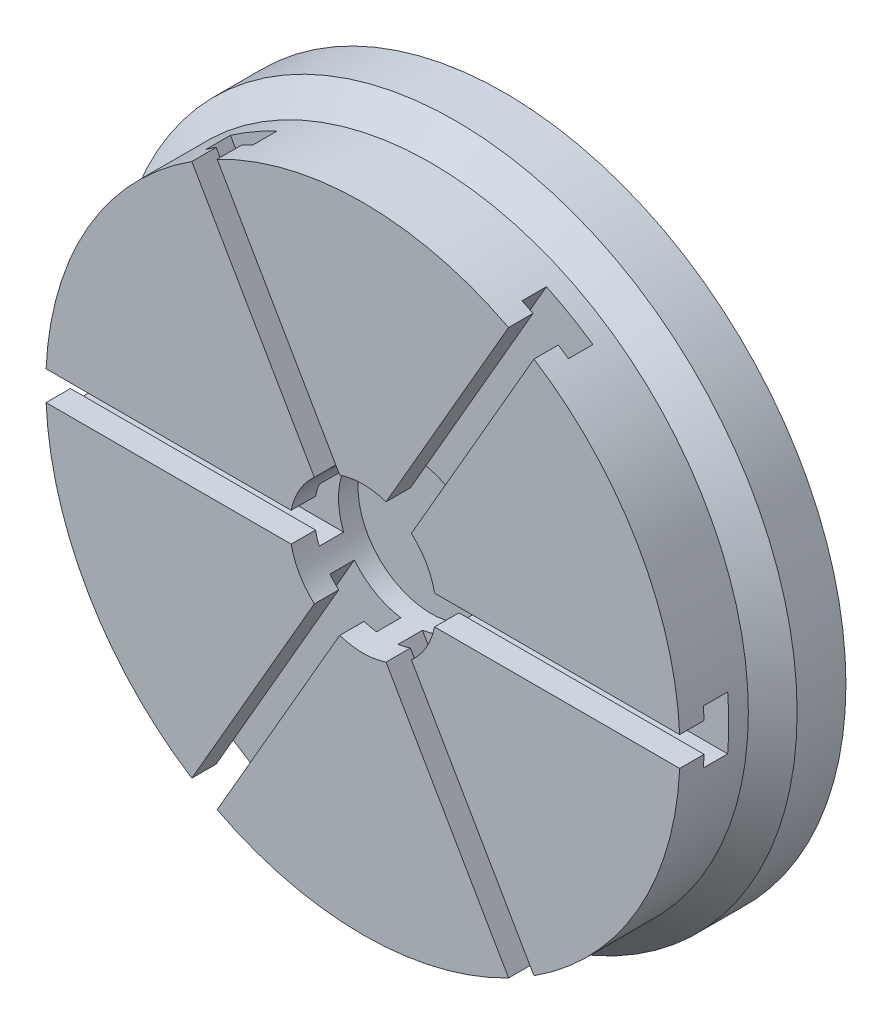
ISO-10303-21;
HEADER;
FILE_DESCRIPTION(('STEP AP214'),'2;1');
FILE_NAME('part.step','',(''),(''),'','','');
FILE_SCHEMA(('AUTOMOTIVE_DESIGN { 1 0 10303 214 1 1 1 1 }'));
ENDSEC;
DATA;
#1=APPLICATION_CONTEXT('core data for automotive mechanical design processes');
#2=APPLICATION_PROTOCOL_DEFINITION('international standard','automotive_design',2000,#1);
#3=PRODUCT_CONTEXT('',#1,'mechanical');
#4=PRODUCT('Part','Part','',(#3));
#5=PRODUCT_RELATED_PRODUCT_CATEGORY('part','',(#4));
#6=PRODUCT_DEFINITION_FORMATION('','',#4);
#7=PRODUCT_DEFINITION_CONTEXT('part definition',#1,'design');
#8=PRODUCT_DEFINITION('design','',#6,#7);
#9=PRODUCT_DEFINITION_SHAPE('','',#8);
#10=(LENGTH_UNIT() NAMED_UNIT(*) SI_UNIT(.MILLI.,.METRE.));
#11=(NAMED_UNIT(*) PLANE_ANGLE_UNIT() SI_UNIT($,.RADIAN.));
#12=(NAMED_UNIT(*) SI_UNIT($,.STERADIAN.) SOLID_ANGLE_UNIT());
#13=UNCERTAINTY_MEASURE_WITH_UNIT(LENGTH_MEASURE(1.E-05),#10,'distance_accuracy_value','');
#14=(GEOMETRIC_REPRESENTATION_CONTEXT(3) GLOBAL_UNCERTAINTY_ASSIGNED_CONTEXT((#13)) GLOBAL_UNIT_ASSIGNED_CONTEXT((#10,
#11,#12)) REPRESENTATION_CONTEXT('',''));
#15=CARTESIAN_POINT('',(0.,0.,0.));
#16=DIRECTION('',(0.,0.,1.));
#17=DIRECTION('',(1.,0.,0.));
#18=AXIS2_PLACEMENT_3D('',#15,#16,#17);
#19=CARTESIAN_POINT('',(0.,0.,58.));
#20=DIRECTION('',(0.,0.,1.));
#21=DIRECTION('',(1.,0.,0.));
#22=AXIS2_PLACEMENT_3D('',#19,#20,#21);
#23=PLANE('',#22);
#24=DIRECTION('',(-0.499999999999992,0.866025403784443,0.));
#25=VECTOR('',#24,1.);
#26=CARTESIAN_POINT('',(75.1961524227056,-118.243556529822,58.));
#27=LINE('',#26,#25);
#28=CARTESIAN_POINT('',(70.1268847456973,-109.463327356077,58.));
#29=VERTEX_POINT('',#28);
#30=CARTESIAN_POINT('',(19.8930908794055,-22.4558441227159,58.));
#31=VERTEX_POINT('',#30);
#32=EDGE_CURVE('E546',#29,#31,#27,.T.);
#33=ORIENTED_EDGE('',*,*,#32,.F.);
#34=CARTESIAN_POINT('',(0.,0.,58.));
#35=DIRECTION('',(0.,0.,1.));
#36=DIRECTION('',(1.,0.,0.));
#37=AXIS2_PLACEMENT_3D('',#34,#35,#36);
#38=CIRCLE('',#37,130.);
#39=CARTESIAN_POINT('',(129.861464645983,-6.,58.));
#40=VERTEX_POINT('',#39);
#41=EDGE_CURVE('E388',#29,#40,#38,.T.);
#42=ORIENTED_EDGE('',*,*,#41,.T.);
#43=DIRECTION('',(1.,0.,0.));
#44=VECTOR('',#43,1.);
#45=CARTESIAN_POINT('',(-140.,-6.,58.));
#46=LINE('',#45,#44);
#47=CARTESIAN_POINT('',(29.3938769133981,-6.,58.));
#48=VERTEX_POINT('',#47);
#49=EDGE_CURVE('E464',#48,#40,#46,.T.);
#50=ORIENTED_EDGE('',*,*,#49,.F.);
#51=CARTESIAN_POINT('',(0.,0.,58.));
#52=DIRECTION('',(0.,0.,1.));
#53=DIRECTION('',(1.,0.,0.));
#54=AXIS2_PLACEMENT_3D('',#51,#52,#53);
#55=CIRCLE('',#54,30.);
#56=EDGE_CURVE('E362',#31,#48,#55,.T.);
#57=ORIENTED_EDGE('',*,*,#56,.F.);
#58=EDGE_LOOP('',(#33,#42,#50,#57));
#59=FACE_BOUND('',#58,.T.);
#60=ADVANCED_FACE('F31',(#59),#23,.T.);
#61=DIRECTION('',(-0.500000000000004,-0.866025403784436,0.));
#62=VECTOR('',#61,1.);
#63=CARTESIAN_POINT('',(64.803847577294,124.243556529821,58.));
#64=LINE('',#63,#62);
#65=CARTESIAN_POINT('',(59.7345799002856,115.463327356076,58.));
#66=VERTEX_POINT('',#65);
#67=CARTESIAN_POINT('',(9.50078603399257,28.4558441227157,58.));
#68=VERTEX_POINT('',#67);
#69=EDGE_CURVE('E704',#66,#68,#64,.T.);
#70=ORIENTED_EDGE('',*,*,#69,.F.);
#71=CARTESIAN_POINT('',(-59.734579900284,115.463327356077,58.));
#72=VERTEX_POINT('',#71);
#73=EDGE_CURVE('E395',#66,#72,#38,.T.);
#74=ORIENTED_EDGE('',*,*,#73,.T.);
#75=DIRECTION('',(-0.499999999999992,0.866025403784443,0.));
#76=VECTOR('',#75,1.);
#77=CARTESIAN_POINT('',(75.1961524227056,-118.243556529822,58.));
#78=LINE('',#77,#76);
#79=CARTESIAN_POINT('',(-9.50078603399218,28.4558441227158,58.));
#80=VERTEX_POINT('',#79);
#81=EDGE_CURVE('E693',#80,#72,#78,.T.);
#82=ORIENTED_EDGE('',*,*,#81,.F.);
#83=EDGE_CURVE('E368',#68,#80,#55,.T.);
#84=ORIENTED_EDGE('',*,*,#83,.F.);
#85=EDGE_LOOP('',(#70,#74,#82,#84));
#86=FACE_BOUND('',#85,.T.);
#87=ADVANCED_FACE('F830',(#86),#23,.T.);
#88=DIRECTION('',(-0.499999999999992,0.866025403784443,0.));
#89=VECTOR('',#88,1.);
#90=CARTESIAN_POINT('',(64.8038475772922,-124.243556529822,58.));
#91=LINE('',#90,#89);
#92=CARTESIAN_POINT('',(-19.8930908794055,22.4558441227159,58.));
#93=VERTEX_POINT('',#92);
#94=CARTESIAN_POINT('',(-70.1268847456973,109.463327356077,58.));
#95=VERTEX_POINT('',#94);
#96=EDGE_CURVE('E648',#93,#95,#91,.T.);
#97=ORIENTED_EDGE('',*,*,#96,.T.);
#98=CARTESIAN_POINT('',(-129.861464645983,6.,58.));
#99=VERTEX_POINT('',#98);
#100=EDGE_CURVE('E548',#95,#99,#38,.T.);
#101=ORIENTED_EDGE('',*,*,#100,.T.);
#102=DIRECTION('',(1.,0.,0.));
#103=VECTOR('',#102,1.);
#104=CARTESIAN_POINT('',(-140.,6.,58.));
#105=LINE('',#104,#103);
#106=CARTESIAN_POINT('',(-29.3938769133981,6.,58.));
#107=VERTEX_POINT('',#106);
#108=EDGE_CURVE('E472',#99,#107,#105,.T.);
#109=ORIENTED_EDGE('',*,*,#108,.T.);
#110=EDGE_CURVE('E364',#93,#107,#55,.T.);
#111=ORIENTED_EDGE('',*,*,#110,.F.);
#112=EDGE_LOOP('',(#97,#101,#109,#111));
#113=FACE_BOUND('',#112,.T.);
#114=ADVANCED_FACE('F836',(#113),#23,.T.);
#115=DIRECTION('',(-0.499999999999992,0.866025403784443,0.));
#116=VECTOR('',#115,1.);
#117=CARTESIAN_POINT('',(64.8038475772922,-124.243556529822,58.));
#118=LINE('',#117,#116);
#119=CARTESIAN_POINT('',(59.734579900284,-115.463327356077,58.));
#120=VERTEX_POINT('',#119);
#121=CARTESIAN_POINT('',(9.50078603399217,-28.4558441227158,58.));
#122=VERTEX_POINT('',#121);
#123=EDGE_CURVE('E339',#120,#122,#118,.T.);
#124=ORIENTED_EDGE('',*,*,#123,.T.);
#125=CARTESIAN_POINT('',(-9.50078603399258,-28.4558441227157,58.));
#126=VERTEX_POINT('',#125);
#127=EDGE_CURVE('E350',#126,#122,#55,.T.);
#128=ORIENTED_EDGE('',*,*,#127,.F.);
#129=DIRECTION('',(-0.500000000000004,-0.866025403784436,0.));
#130=VECTOR('',#129,1.);
#131=CARTESIAN_POINT('',(75.1961524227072,118.243556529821,58.));
#132=LINE('',#131,#130);
#133=CARTESIAN_POINT('',(-59.7345799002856,-115.463327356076,58.));
#134=VERTEX_POINT('',#133);
#135=EDGE_CURVE('E617',#126,#134,#132,.T.);
#136=ORIENTED_EDGE('',*,*,#135,.T.);
#137=EDGE_CURVE('E352',#134,#120,#38,.T.);
#138=ORIENTED_EDGE('',*,*,#137,.T.);
#139=EDGE_LOOP('',(#124,#128,#136,#138));
#140=FACE_BOUND('',#139,.T.);
#141=ADVANCED_FACE('F348',(#140),#23,.T.);
#142=DIRECTION('',(-0.500000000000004,-0.866025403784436,0.));
#143=VECTOR('',#142,1.);
#144=CARTESIAN_POINT('',(75.1961524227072,118.243556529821,58.));
#145=LINE('',#144,#143);
#146=CARTESIAN_POINT('',(70.1268847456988,109.463327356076,58.));
#147=VERTEX_POINT('',#146);
#148=CARTESIAN_POINT('',(19.8930908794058,22.4558441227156,58.));
#149=VERTEX_POINT('',#148);
#150=EDGE_CURVE('E746',#147,#149,#145,.T.);
#151=ORIENTED_EDGE('',*,*,#150,.T.);
#152=CARTESIAN_POINT('',(29.3938769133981,6.,58.));
#153=VERTEX_POINT('',#152);
#154=EDGE_CURVE('E366',#153,#149,#55,.T.);
#155=ORIENTED_EDGE('',*,*,#154,.F.);
#156=CARTESIAN_POINT('',(129.861464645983,6.,58.));
#157=VERTEX_POINT('',#156);
#158=EDGE_CURVE('E511',#153,#157,#105,.T.);
#159=ORIENTED_EDGE('',*,*,#158,.T.);
#160=EDGE_CURVE('E391',#157,#147,#38,.T.);
#161=ORIENTED_EDGE('',*,*,#160,.T.);
#162=EDGE_LOOP('',(#151,#155,#159,#161));
#163=FACE_BOUND('',#162,.T.);
#164=ADVANCED_FACE('F516',(#163),#23,.T.);
#165=CARTESIAN_POINT('',(0.,0.,30.));
#166=DIRECTION('',(0.,0.,-1.));
#167=DIRECTION('',(-1.,0.,0.));
#168=AXIS2_PLACEMENT_3D('',#165,#166,#167);
#169=CYLINDRICAL_SURFACE('',#168,140.);
#170=CARTESIAN_POINT('',(0.,0.,20.));
#171=DIRECTION('',(0.,0.,1.));
#172=DIRECTION('',(1.,0.,0.));
#173=AXIS2_PLACEMENT_3D('',#170,#171,#172);
#174=CIRCLE('',#173,140.);
#175=CARTESIAN_POINT('',(140.,0.,20.));
#176=VERTEX_POINT('',#175);
#177=EDGE_CURVE('E399',#176,#176,#174,.F.);
#178=ORIENTED_EDGE('',*,*,#177,.T.);
#179=EDGE_LOOP('',(#178));
#180=FACE_BOUND('',#179,.T.);
#181=CARTESIAN_POINT('',(0.,0.,0.));
#182=DIRECTION('',(0.,0.,1.));
#183=DIRECTION('',(1.,0.,0.));
#184=AXIS2_PLACEMENT_3D('',#181,#182,#183);
#185=CIRCLE('',#184,140.);
#186=CARTESIAN_POINT('',(140.,0.,0.));
#187=VERTEX_POINT('',#186);
#188=EDGE_CURVE('E394',#187,#187,#185,.T.);
#189=ORIENTED_EDGE('',*,*,#188,.T.);
#190=EDGE_LOOP('',(#189));
#191=FACE_BOUND('',#190,.T.);
#192=ADVANCED_FACE('F33',(#180,#191),#169,.T.);
#193=CARTESIAN_POINT('',(0.,0.,0.));
#194=DIRECTION('',(0.,0.,1.));
#195=DIRECTION('',(1.,0.,0.));
#196=AXIS2_PLACEMENT_3D('',#193,#194,#195);
#197=PLANE('',#196);
#198=ORIENTED_EDGE('',*,*,#188,.F.);
#199=EDGE_LOOP('',(#198));
#200=FACE_BOUND('',#199,.T.);
#201=ADVANCED_FACE('F847',(#200),#197,.F.);
#202=CARTESIAN_POINT('',(0.,0.,58.));
#203=DIRECTION('',(0.,0.,-1.));
#204=DIRECTION('',(-1.,0.,0.));
#205=AXIS2_PLACEMENT_3D('',#202,#203,#204);
#206=CYLINDRICAL_SURFACE('',#205,130.);
#207=ORIENTED_EDGE('',*,*,#41,.F.);
#208=DIRECTION('',(0.,0.,-1.));
#209=VECTOR('',#208,1.);
#210=CARTESIAN_POINT('',(70.1268847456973,-109.463327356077,58.));
#211=LINE('',#210,#209);
#212=CARTESIAN_POINT('',(70.1268847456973,-109.463327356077,48.));
#213=VERTEX_POINT('',#212);
#214=EDGE_CURVE('E752',#29,#213,#211,.T.);
#215=ORIENTED_EDGE('',*,*,#214,.T.);
#216=CARTESIAN_POINT('',(0.,0.,48.));
#217=DIRECTION('',(0.,0.,1.));
#218=DIRECTION('',(-0.499999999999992,0.866025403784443,0.));
#219=AXIS2_PLACEMENT_3D('',#216,#217,#218);
#220=CIRCLE('',#219,130.);
#221=CARTESIAN_POINT('',(74.2931691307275,-106.67954358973,48.));
#222=VERTEX_POINT('',#221);
#223=EDGE_CURVE('E758',#213,#222,#220,.T.);
#224=ORIENTED_EDGE('',*,*,#223,.T.);
#225=DIRECTION('',(0.,0.,-1.));
#226=VECTOR('',#225,1.);
#227=CARTESIAN_POINT('',(74.2931691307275,-106.67954358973,58.));
#228=LINE('',#227,#226);
#229=CARTESIAN_POINT('',(74.2931691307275,-106.67954358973,38.));
#230=VERTEX_POINT('',#229);
#231=EDGE_CURVE('E765',#222,#230,#228,.T.);
#232=ORIENTED_EDGE('',*,*,#231,.T.);
#233=CARTESIAN_POINT('',(0.,0.,38.));
#234=DIRECTION('',(0.,0.,-1.));
#235=DIRECTION('',(0.499999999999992,-0.866025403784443,0.));
#236=AXIS2_PLACEMENT_3D('',#233,#234,#235);
#237=CIRCLE('',#236,130.);
#238=CARTESIAN_POINT('',(55.2406102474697,-117.67954358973,38.));
#239=VERTEX_POINT('',#238);
#240=EDGE_CURVE('E773',#230,#239,#237,.T.);
#241=ORIENTED_EDGE('',*,*,#240,.T.);
#242=DIRECTION('',(0.,0.,-1.));
#243=VECTOR('',#242,1.);
#244=CARTESIAN_POINT('',(55.2406102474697,-117.67954358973,58.));
#245=LINE('',#244,#243);
#246=CARTESIAN_POINT('',(55.2406102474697,-117.67954358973,48.));
#247=VERTEX_POINT('',#246);
#248=EDGE_CURVE('E781',#239,#247,#245,.F.);
#249=ORIENTED_EDGE('',*,*,#248,.T.);
#250=CARTESIAN_POINT('',(0.,0.,48.));
#251=DIRECTION('',(0.,0.,1.));
#252=DIRECTION('',(0.866025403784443,0.499999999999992,0.));
#253=AXIS2_PLACEMENT_3D('',#250,#251,#252);
#254=CIRCLE('',#253,130.);
#255=CARTESIAN_POINT('',(59.734579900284,-115.463327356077,48.));
#256=VERTEX_POINT('',#255);
#257=EDGE_CURVE('E789',#247,#256,#254,.T.);
#258=ORIENTED_EDGE('',*,*,#257,.T.);
#259=DIRECTION('',(0.,0.,-1.));
#260=VECTOR('',#259,1.);
#261=CARTESIAN_POINT('',(59.734579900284,-115.463327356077,58.));
#262=LINE('',#261,#260);
#263=EDGE_CURVE('E353',#256,#120,#262,.F.);
#264=ORIENTED_EDGE('',*,*,#263,.T.);
#265=ORIENTED_EDGE('',*,*,#137,.F.);
#266=DIRECTION('',(0.,0.,-1.));
#267=VECTOR('',#266,1.);
#268=CARTESIAN_POINT('',(-59.7345799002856,-115.463327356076,58.));
#269=LINE('',#268,#267);
#270=CARTESIAN_POINT('',(-59.7345799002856,-115.463327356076,48.));
#271=VERTEX_POINT('',#270);
#272=EDGE_CURVE('E467',#134,#271,#269,.T.);
#273=ORIENTED_EDGE('',*,*,#272,.T.);
#274=CARTESIAN_POINT('',(0.,0.,48.));
#275=DIRECTION('',(0.,0.,1.));
#276=DIRECTION('',(-0.866025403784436,0.500000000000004,0.));
#277=AXIS2_PLACEMENT_3D('',#274,#275,#276);
#278=CIRCLE('',#277,130.);
#279=CARTESIAN_POINT('',(-55.2406102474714,-117.679543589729,48.));
#280=VERTEX_POINT('',#279);
#281=EDGE_CURVE('E614',#271,#280,#278,.T.);
#282=ORIENTED_EDGE('',*,*,#281,.T.);
#283=DIRECTION('',(0.,0.,-1.));
#284=VECTOR('',#283,1.);
#285=CARTESIAN_POINT('',(-55.2406102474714,-117.679543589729,58.));
#286=LINE('',#285,#284);
#287=CARTESIAN_POINT('',(-55.2406102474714,-117.679543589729,38.));
#288=VERTEX_POINT('',#287);
#289=EDGE_CURVE('E607',#280,#288,#286,.T.);
#290=ORIENTED_EDGE('',*,*,#289,.T.);
#291=CARTESIAN_POINT('',(0.,0.,38.));
#292=DIRECTION('',(0.,0.,-1.));
#293=DIRECTION('',(0.500000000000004,0.866025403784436,0.));
#294=AXIS2_PLACEMENT_3D('',#291,#292,#293);
#295=CIRCLE('',#294,130.);
#296=CARTESIAN_POINT('',(-74.293169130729,-106.679543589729,38.));
#297=VERTEX_POINT('',#296);
#298=EDGE_CURVE('E599',#288,#297,#295,.T.);
#299=ORIENTED_EDGE('',*,*,#298,.T.);
#300=DIRECTION('',(0.,0.,-1.));
#301=VECTOR('',#300,1.);
#302=CARTESIAN_POINT('',(-74.293169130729,-106.679543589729,58.));
#303=LINE('',#302,#301);
#304=CARTESIAN_POINT('',(-74.293169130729,-106.679543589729,48.));
#305=VERTEX_POINT('',#304);
#306=EDGE_CURVE('E592',#297,#305,#303,.F.);
#307=ORIENTED_EDGE('',*,*,#306,.T.);
#308=CARTESIAN_POINT('',(0.,0.,48.));
#309=DIRECTION('',(0.,0.,1.));
#310=DIRECTION('',(-0.500000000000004,-0.866025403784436,0.));
#311=AXIS2_PLACEMENT_3D('',#308,#309,#310);
#312=CIRCLE('',#311,130.);
#313=CARTESIAN_POINT('',(-70.1268847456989,-109.463327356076,48.));
#314=VERTEX_POINT('',#313);
#315=EDGE_CURVE('E573',#305,#314,#312,.T.);
#316=ORIENTED_EDGE('',*,*,#315,.T.);
#317=DIRECTION('',(0.,0.,-1.));
#318=VECTOR('',#317,1.);
#319=CARTESIAN_POINT('',(-70.1268847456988,-109.463327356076,58.));
#320=LINE('',#319,#318);
#321=CARTESIAN_POINT('',(-70.1268847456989,-109.463327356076,58.));
#322=VERTEX_POINT('',#321);
#323=EDGE_CURVE('E570',#314,#322,#320,.F.);
#324=ORIENTED_EDGE('',*,*,#323,.T.);
#325=CARTESIAN_POINT('',(-129.861464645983,-6.,58.));
#326=VERTEX_POINT('',#325);
#327=EDGE_CURVE('E396',#326,#322,#38,.T.);
#328=ORIENTED_EDGE('',*,*,#327,.F.);
#329=DIRECTION('',(0.,0.,-1.));
#330=VECTOR('',#329,1.);
#331=CARTESIAN_POINT('',(-129.861464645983,-6.,58.));
#332=LINE('',#331,#330);
#333=CARTESIAN_POINT('',(-129.861464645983,-6.,48.));
#334=VERTEX_POINT('',#333);
#335=EDGE_CURVE('E471',#326,#334,#332,.T.);
#336=ORIENTED_EDGE('',*,*,#335,.T.);
#337=CARTESIAN_POINT('',(0.,0.,48.));
#338=DIRECTION('',(0.,0.,1.));
#339=DIRECTION('',(1.,0.,0.));
#340=AXIS2_PLACEMENT_3D('',#337,#338,#339);
#341=CIRCLE('',#340,130.);
#342=CARTESIAN_POINT('',(-129.533779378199,-11.,48.));
#343=VERTEX_POINT('',#342);
#344=EDGE_CURVE('E478',#334,#343,#341,.T.);
#345=ORIENTED_EDGE('',*,*,#344,.T.);
#346=DIRECTION('',(0.,0.,-1.));
#347=VECTOR('',#346,1.);
#348=CARTESIAN_POINT('',(-129.533779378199,-11.,58.));
#349=LINE('',#348,#347);
#350=CARTESIAN_POINT('',(-129.533779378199,-11.,38.));
#351=VERTEX_POINT('',#350);
#352=EDGE_CURVE('E480',#343,#351,#349,.T.);
#353=ORIENTED_EDGE('',*,*,#352,.T.);
#354=CARTESIAN_POINT('',(0.,0.,38.));
#355=DIRECTION('',(0.,0.,-1.));
#356=DIRECTION('',(-1.,0.,0.));
#357=AXIS2_PLACEMENT_3D('',#354,#355,#356);
#358=CIRCLE('',#357,130.);
#359=CARTESIAN_POINT('',(-129.533779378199,11.,38.));
#360=VERTEX_POINT('',#359);
#361=EDGE_CURVE('E483',#351,#360,#358,.T.);
#362=ORIENTED_EDGE('',*,*,#361,.T.);
#363=DIRECTION('',(0.,0.,-1.));
#364=VECTOR('',#363,1.);
#365=CARTESIAN_POINT('',(-129.533779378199,11.,58.));
#366=LINE('',#365,#364);
#367=CARTESIAN_POINT('',(-129.533779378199,11.,48.));
#368=VERTEX_POINT('',#367);
#369=EDGE_CURVE('E487',#360,#368,#366,.F.);
#370=ORIENTED_EDGE('',*,*,#369,.T.);
#371=CARTESIAN_POINT('',(0.,0.,48.));
#372=DIRECTION('',(0.,0.,1.));
#373=DIRECTION('',(0.,-1.,0.));
#374=AXIS2_PLACEMENT_3D('',#371,#372,#373);
#375=CIRCLE('',#374,130.);
#376=CARTESIAN_POINT('',(-129.861464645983,6.,48.));
#377=VERTEX_POINT('',#376);
#378=EDGE_CURVE('E493',#368,#377,#375,.T.);
#379=ORIENTED_EDGE('',*,*,#378,.T.);
#380=DIRECTION('',(0.,0.,-1.));
#381=VECTOR('',#380,1.);
#382=CARTESIAN_POINT('',(-129.861464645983,6.,58.));
#383=LINE('',#382,#381);
#384=EDGE_CURVE('E497',#377,#99,#383,.F.);
#385=ORIENTED_EDGE('',*,*,#384,.T.);
#386=ORIENTED_EDGE('',*,*,#100,.F.);
#387=DIRECTION('',(0.,0.,-1.));
#388=VECTOR('',#387,1.);
#389=CARTESIAN_POINT('',(-70.1268847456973,109.463327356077,58.));
#390=LINE('',#389,#388);
#391=CARTESIAN_POINT('',(-70.1268847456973,109.463327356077,48.));
#392=VERTEX_POINT('',#391);
#393=EDGE_CURVE('E641',#95,#392,#390,.T.);
#394=ORIENTED_EDGE('',*,*,#393,.T.);
#395=CARTESIAN_POINT('',(0.,0.,48.));
#396=DIRECTION('',(0.,0.,1.));
#397=DIRECTION('',(0.866025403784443,0.499999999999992,0.));
#398=AXIS2_PLACEMENT_3D('',#395,#396,#397);
#399=CIRCLE('',#398,130.);
#400=CARTESIAN_POINT('',(-74.2931691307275,106.67954358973,48.));
#401=VERTEX_POINT('',#400);
#402=EDGE_CURVE('E650',#392,#401,#399,.T.);
#403=ORIENTED_EDGE('',*,*,#402,.T.);
#404=DIRECTION('',(0.,0.,-1.));
#405=VECTOR('',#404,1.);
#406=CARTESIAN_POINT('',(-74.2931691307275,106.67954358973,58.));
#407=LINE('',#406,#405);
#408=CARTESIAN_POINT('',(-74.2931691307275,106.67954358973,38.));
#409=VERTEX_POINT('',#408);
#410=EDGE_CURVE('E658',#401,#409,#407,.T.);
#411=ORIENTED_EDGE('',*,*,#410,.T.);
#412=CARTESIAN_POINT('',(0.,0.,38.));
#413=DIRECTION('',(0.,0.,-1.));
#414=DIRECTION('',(0.499999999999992,-0.866025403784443,0.));
#415=AXIS2_PLACEMENT_3D('',#412,#413,#414);
#416=CIRCLE('',#415,130.);
#417=CARTESIAN_POINT('',(-55.2406102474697,117.67954358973,38.));
#418=VERTEX_POINT('',#417);
#419=EDGE_CURVE('E666',#409,#418,#416,.T.);
#420=ORIENTED_EDGE('',*,*,#419,.T.);
#421=DIRECTION('',(0.,0.,-1.));
#422=VECTOR('',#421,1.);
#423=CARTESIAN_POINT('',(-55.2406102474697,117.67954358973,58.));
#424=LINE('',#423,#422);
#425=CARTESIAN_POINT('',(-55.2406102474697,117.67954358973,48.));
#426=VERTEX_POINT('',#425);
#427=EDGE_CURVE('E674',#418,#426,#424,.F.);
#428=ORIENTED_EDGE('',*,*,#427,.T.);
#429=CARTESIAN_POINT('',(0.,0.,48.));
#430=DIRECTION('',(0.,0.,1.));
#431=DIRECTION('',(-0.499999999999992,0.866025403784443,0.));
#432=AXIS2_PLACEMENT_3D('',#429,#430,#431);
#433=CIRCLE('',#432,130.);
#434=CARTESIAN_POINT('',(-59.734579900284,115.463327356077,48.));
#435=VERTEX_POINT('',#434);
#436=EDGE_CURVE('E682',#426,#435,#433,.T.);
#437=ORIENTED_EDGE('',*,*,#436,.T.);
#438=DIRECTION('',(0.,0.,-1.));
#439=VECTOR('',#438,1.);
#440=CARTESIAN_POINT('',(-59.734579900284,115.463327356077,58.));
#441=LINE('',#440,#439);
#442=EDGE_CURVE('E690',#435,#72,#441,.F.);
#443=ORIENTED_EDGE('',*,*,#442,.T.);
#444=ORIENTED_EDGE('',*,*,#73,.F.);
#445=DIRECTION('',(0.,0.,-1.));
#446=VECTOR('',#445,1.);
#447=CARTESIAN_POINT('',(59.7345799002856,115.463327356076,58.));
#448=LINE('',#447,#446);
#449=CARTESIAN_POINT('',(59.7345799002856,115.463327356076,48.));
#450=VERTEX_POINT('',#449);
#451=EDGE_CURVE('E699',#66,#450,#448,.T.);
#452=ORIENTED_EDGE('',*,*,#451,.T.);
#453=CARTESIAN_POINT('',(0.,0.,48.));
#454=DIRECTION('',(0.,0.,1.));
#455=DIRECTION('',(-0.500000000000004,-0.866025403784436,0.));
#456=AXIS2_PLACEMENT_3D('',#453,#454,#455);
#457=CIRCLE('',#456,130.);
#458=CARTESIAN_POINT('',(55.2406102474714,117.679543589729,48.));
#459=VERTEX_POINT('',#458);
#460=EDGE_CURVE('E706',#450,#459,#457,.T.);
#461=ORIENTED_EDGE('',*,*,#460,.T.);
#462=DIRECTION('',(0.,0.,-1.));
#463=VECTOR('',#462,1.);
#464=CARTESIAN_POINT('',(55.2406102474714,117.679543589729,58.));
#465=LINE('',#464,#463);
#466=CARTESIAN_POINT('',(55.2406102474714,117.679543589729,38.));
#467=VERTEX_POINT('',#466);
#468=EDGE_CURVE('E714',#459,#467,#465,.T.);
#469=ORIENTED_EDGE('',*,*,#468,.T.);
#470=CARTESIAN_POINT('',(0.,0.,38.));
#471=DIRECTION('',(0.,0.,-1.));
#472=DIRECTION('',(0.500000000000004,0.866025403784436,0.));
#473=AXIS2_PLACEMENT_3D('',#470,#471,#472);
#474=CIRCLE('',#473,130.);
#475=CARTESIAN_POINT('',(74.293169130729,106.679543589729,38.));
#476=VERTEX_POINT('',#475);
#477=EDGE_CURVE('E722',#467,#476,#474,.T.);
#478=ORIENTED_EDGE('',*,*,#477,.T.);
#479=DIRECTION('',(0.,0.,-1.));
#480=VECTOR('',#479,1.);
#481=CARTESIAN_POINT('',(74.293169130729,106.679543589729,58.));
#482=LINE('',#481,#480);
#483=CARTESIAN_POINT('',(74.293169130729,106.679543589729,48.));
#484=VERTEX_POINT('',#483);
#485=EDGE_CURVE('E730',#476,#484,#482,.F.);
#486=ORIENTED_EDGE('',*,*,#485,.T.);
#487=CARTESIAN_POINT('',(0.,0.,48.));
#488=DIRECTION('',(0.,0.,1.));
#489=DIRECTION('',(-0.866025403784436,0.500000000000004,0.));
#490=AXIS2_PLACEMENT_3D('',#487,#488,#489);
#491=CIRCLE('',#490,130.);
#492=CARTESIAN_POINT('',(70.1268847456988,109.463327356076,48.));
#493=VERTEX_POINT('',#492);
#494=EDGE_CURVE('E738',#484,#493,#491,.T.);
#495=ORIENTED_EDGE('',*,*,#494,.T.);
#496=DIRECTION('',(0.,0.,-1.));
#497=VECTOR('',#496,1.);
#498=CARTESIAN_POINT('',(70.1268847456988,109.463327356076,58.));
#499=LINE('',#498,#497);
#500=EDGE_CURVE('E744',#493,#147,#499,.F.);
#501=ORIENTED_EDGE('',*,*,#500,.T.);
#502=ORIENTED_EDGE('',*,*,#160,.F.);
#503=DIRECTION('',(0.,0.,-1.));
#504=VECTOR('',#503,1.);
#505=CARTESIAN_POINT('',(129.861464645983,6.,58.));
#506=LINE('',#505,#504);
#507=CARTESIAN_POINT('',(129.861464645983,6.,48.));
#508=VERTEX_POINT('',#507);
#509=EDGE_CURVE('E367',#157,#508,#506,.T.);
#510=ORIENTED_EDGE('',*,*,#509,.T.);
#511=CARTESIAN_POINT('',(129.533779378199,11.,48.));
#512=VERTEX_POINT('',#511);
#513=EDGE_CURVE('E496',#508,#512,#375,.T.);
#514=ORIENTED_EDGE('',*,*,#513,.T.);
#515=DIRECTION('',(0.,0.,-1.));
#516=VECTOR('',#515,1.);
#517=CARTESIAN_POINT('',(129.533779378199,11.,58.));
#518=LINE('',#517,#516);
#519=CARTESIAN_POINT('',(129.533779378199,11.,38.));
#520=VERTEX_POINT('',#519);
#521=EDGE_CURVE('E490',#512,#520,#518,.T.);
#522=ORIENTED_EDGE('',*,*,#521,.T.);
#523=CARTESIAN_POINT('',(129.533779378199,-11.,38.));
#524=VERTEX_POINT('',#523);
#525=EDGE_CURVE('E486',#520,#524,#358,.T.);
#526=ORIENTED_EDGE('',*,*,#525,.T.);
#527=DIRECTION('',(0.,0.,-1.));
#528=VECTOR('',#527,1.);
#529=CARTESIAN_POINT('',(129.533779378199,-11.,58.));
#530=LINE('',#529,#528);
#531=CARTESIAN_POINT('',(129.533779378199,-11.,48.));
#532=VERTEX_POINT('',#531);
#533=EDGE_CURVE('E448',#524,#532,#530,.F.);
#534=ORIENTED_EDGE('',*,*,#533,.T.);
#535=CARTESIAN_POINT('',(129.861464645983,-6.,48.));
#536=VERTEX_POINT('',#535);
#537=EDGE_CURVE('E475',#532,#536,#341,.T.);
#538=ORIENTED_EDGE('',*,*,#537,.T.);
#539=DIRECTION('',(0.,0.,-1.));
#540=VECTOR('',#539,1.);
#541=CARTESIAN_POINT('',(129.861464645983,-6.,58.));
#542=LINE('',#541,#540);
#543=EDGE_CURVE('E468',#536,#40,#542,.F.);
#544=ORIENTED_EDGE('',*,*,#543,.T.);
#545=EDGE_LOOP('',(#207,#215,#224,#232,#241,#249,#258,#264,#265,#273,#282,#290,#299,#307,#316,
#324,#328,#336,#345,#353,#362,#370,#379,#385,#386,#394,#403,#411,#420,#428,#437,#443,#444,#452,
#461,#469,#478,#486,#495,#501,#502,#510,#514,#522,#526,#534,#538,#544));
#546=FACE_BOUND('',#545,.T.);
#547=CARTESIAN_POINT('',(0.,0.,30.));
#548=DIRECTION('',(0.,0.,1.));
#549=DIRECTION('',(1.,0.,0.));
#550=AXIS2_PLACEMENT_3D('',#547,#548,#549);
#551=CIRCLE('',#550,130.);
#552=CARTESIAN_POINT('',(130.,0.,30.));
#553=VERTEX_POINT('',#552);
#554=EDGE_CURVE('E384',#553,#553,#551,.T.);
#555=ORIENTED_EDGE('',*,*,#554,.T.);
#556=EDGE_LOOP('',(#555));
#557=FACE_BOUND('',#556,.T.);
#558=ADVANCED_FACE('F504',(#546,#557),#206,.T.);
#559=DIRECTION('',(-0.500000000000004,-0.866025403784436,0.));
#560=VECTOR('',#559,1.);
#561=CARTESIAN_POINT('',(64.803847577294,124.243556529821,58.));
#562=LINE('',#561,#560);
#563=CARTESIAN_POINT('',(-19.8930908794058,-22.4558441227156,58.));
#564=VERTEX_POINT('',#563);
#565=EDGE_CURVE('E565',#564,#322,#562,.T.);
#566=ORIENTED_EDGE('',*,*,#565,.F.);
#567=CARTESIAN_POINT('',(-29.3938769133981,-6.,58.));
#568=VERTEX_POINT('',#567);
#569=EDGE_CURVE('E361',#568,#564,#55,.T.);
#570=ORIENTED_EDGE('',*,*,#569,.F.);
#571=EDGE_CURVE('E463',#326,#568,#46,.T.);
#572=ORIENTED_EDGE('',*,*,#571,.F.);
#573=ORIENTED_EDGE('',*,*,#327,.T.);
#574=EDGE_LOOP('',(#566,#570,#572,#573));
#575=FACE_BOUND('',#574,.T.);
#576=ADVANCED_FACE('F563',(#575),#23,.T.);
#577=CARTESIAN_POINT('',(0.,0.,30.));
#578=DIRECTION('',(0.,0.,-1.));
#579=DIRECTION('',(-1.,0.,0.));
#580=AXIS2_PLACEMENT_3D('',#577,#578,#579);
#581=CONICAL_SURFACE('',#580,130.,0.785398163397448);
#582=ORIENTED_EDGE('',*,*,#177,.F.);
#583=EDGE_LOOP('',(#582));
#584=FACE_BOUND('',#583,.T.);
#585=ORIENTED_EDGE('',*,*,#554,.F.);
#586=EDGE_LOOP('',(#585));
#587=FACE_BOUND('',#586,.T.);
#588=ADVANCED_FACE('F840',(#584,#587),#581,.T.);
#589=CARTESIAN_POINT('',(0.,0.,30.));
#590=DIRECTION('',(0.,0.,1.));
#591=DIRECTION('',(1.,0.,0.));
#592=AXIS2_PLACEMENT_3D('',#589,#590,#591);
#593=CYLINDRICAL_SURFACE('',#592,30.);
#594=CARTESIAN_POINT('',(0.,0.,30.));
#595=DIRECTION('',(0.,0.,1.));
#596=DIRECTION('',(1.,0.,0.));
#597=AXIS2_PLACEMENT_3D('',#594,#595,#596);
#598=CIRCLE('',#597,30.);
#599=CARTESIAN_POINT('',(30.,0.,30.));
#600=VERTEX_POINT('',#599);
#601=EDGE_CURVE('E380',#600,#600,#598,.T.);
#602=ORIENTED_EDGE('',*,*,#601,.F.);
#603=EDGE_LOOP('',(#602));
#604=FACE_BOUND('',#603,.T.);
#605=CARTESIAN_POINT('',(0.,0.,48.));
#606=DIRECTION('',(0.,0.,1.));
#607=DIRECTION('',(-0.499999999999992,0.866025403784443,0.));
#608=AXIS2_PLACEMENT_3D('',#605,#606,#607);
#609=CIRCLE('',#608,30.);
#610=CARTESIAN_POINT('',(23.4815651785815,-18.6712639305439,48.));
#611=VERTEX_POINT('',#610);
#612=CARTESIAN_POINT('',(19.8930908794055,-22.4558441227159,48.));
#613=VERTEX_POINT('',#612);
#614=EDGE_CURVE('E761',#611,#613,#609,.F.);
#615=ORIENTED_EDGE('',*,*,#614,.T.);
#616=DIRECTION('',(0.,0.,1.));
#617=VECTOR('',#616,1.);
#618=CARTESIAN_POINT('',(19.8930908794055,-22.4558441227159,30.));
#619=LINE('',#618,#617);
#620=EDGE_CURVE('E754',#613,#31,#619,.T.);
#621=ORIENTED_EDGE('',*,*,#620,.T.);
#622=ORIENTED_EDGE('',*,*,#56,.T.);
#623=DIRECTION('',(0.,0.,1.));
#624=VECTOR('',#623,1.);
#625=CARTESIAN_POINT('',(29.3938769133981,-6.,30.));
#626=LINE('',#625,#624);
#627=CARTESIAN_POINT('',(29.3938769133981,-6.,48.));
#628=VERTEX_POINT('',#627);
#629=EDGE_CURVE('E424',#48,#628,#626,.F.);
#630=ORIENTED_EDGE('',*,*,#629,.T.);
#631=CARTESIAN_POINT('',(0.,0.,48.));
#632=DIRECTION('',(0.,0.,1.));
#633=DIRECTION('',(1.,0.,0.));
#634=AXIS2_PLACEMENT_3D('',#631,#632,#633);
#635=CIRCLE('',#634,30.);
#636=CARTESIAN_POINT('',(27.9105714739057,-11.,48.));
#637=VERTEX_POINT('',#636);
#638=EDGE_CURVE('E409',#628,#637,#635,.F.);
#639=ORIENTED_EDGE('',*,*,#638,.T.);
#640=DIRECTION('',(0.,0.,1.));
#641=VECTOR('',#640,1.);
#642=CARTESIAN_POINT('',(27.9105714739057,-11.,30.));
#643=LINE('',#642,#641);
#644=CARTESIAN_POINT('',(27.9105714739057,-11.,38.));
#645=VERTEX_POINT('',#644);
#646=EDGE_CURVE('E427',#637,#645,#643,.F.);
#647=ORIENTED_EDGE('',*,*,#646,.T.);
#648=CARTESIAN_POINT('',(0.,0.,38.));
#649=DIRECTION('',(0.,0.,-1.));
#650=DIRECTION('',(-1.,0.,0.));
#651=AXIS2_PLACEMENT_3D('',#648,#649,#650);
#652=CIRCLE('',#651,30.);
#653=CARTESIAN_POINT('',(27.9105714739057,11.,38.));
#654=VERTEX_POINT('',#653);
#655=EDGE_CURVE('E416',#645,#654,#652,.F.);
#656=ORIENTED_EDGE('',*,*,#655,.T.);
#657=DIRECTION('',(0.,0.,1.));
#658=VECTOR('',#657,1.);
#659=CARTESIAN_POINT('',(27.9105714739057,11.,30.));
#660=LINE('',#659,#658);
#661=CARTESIAN_POINT('',(27.9105714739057,11.,48.));
#662=VERTEX_POINT('',#661);
#663=EDGE_CURVE('E429',#654,#662,#660,.T.);
#664=ORIENTED_EDGE('',*,*,#663,.T.);
#665=CARTESIAN_POINT('',(0.,0.,48.));
#666=DIRECTION('',(0.,0.,1.));
#667=DIRECTION('',(0.,-1.,0.));
#668=AXIS2_PLACEMENT_3D('',#665,#666,#667);
#669=CIRCLE('',#668,30.);
#670=CARTESIAN_POINT('',(29.3938769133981,6.,48.));
#671=VERTEX_POINT('',#670);
#672=EDGE_CURVE('E39',#662,#671,#669,.F.);
#673=ORIENTED_EDGE('',*,*,#672,.T.);
#674=DIRECTION('',(0.,0.,1.));
#675=VECTOR('',#674,1.);
#676=CARTESIAN_POINT('',(29.3938769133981,6.,30.));
#677=LINE('',#676,#675);
#678=EDGE_CURVE('E11',#671,#153,#677,.T.);
#679=ORIENTED_EDGE('',*,*,#678,.T.);
#680=ORIENTED_EDGE('',*,*,#154,.T.);
#681=DIRECTION('',(0.,0.,1.));
#682=VECTOR('',#681,1.);
#683=CARTESIAN_POINT('',(19.8930908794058,22.4558441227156,30.));
#684=LINE('',#683,#682);
#685=CARTESIAN_POINT('',(19.8930908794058,22.4558441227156,48.));
#686=VERTEX_POINT('',#685);
#687=EDGE_CURVE('E750',#149,#686,#684,.F.);
#688=ORIENTED_EDGE('',*,*,#687,.T.);
#689=CARTESIAN_POINT('',(0.,0.,48.));
#690=DIRECTION('',(0.,0.,1.));
#691=DIRECTION('',(-0.866025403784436,0.500000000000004,0.));
#692=AXIS2_PLACEMENT_3D('',#689,#690,#691);
#693=CIRCLE('',#692,30.);
#694=CARTESIAN_POINT('',(23.4815651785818,18.6712639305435,48.));
#695=VERTEX_POINT('',#694);
#696=EDGE_CURVE('E54',#686,#695,#693,.F.);
#697=ORIENTED_EDGE('',*,*,#696,.T.);
#698=DIRECTION('',(0.,0.,1.));
#699=VECTOR('',#698,1.);
#700=CARTESIAN_POINT('',(23.4815651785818,18.6712639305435,30.));
#701=LINE('',#700,#699);
#702=CARTESIAN_POINT('',(23.4815651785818,18.6712639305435,38.));
#703=VERTEX_POINT('',#702);
#704=EDGE_CURVE('E733',#695,#703,#701,.F.);
#705=ORIENTED_EDGE('',*,*,#704,.T.);
#706=CARTESIAN_POINT('',(0.,0.,38.));
#707=DIRECTION('',(0.,0.,-1.));
#708=DIRECTION('',(0.500000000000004,0.866025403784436,0.));
#709=AXIS2_PLACEMENT_3D('',#706,#707,#708);
#710=CIRCLE('',#709,30.);
#711=CARTESIAN_POINT('',(4.42900629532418,29.6712639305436,38.));
#712=VERTEX_POINT('',#711);
#713=EDGE_CURVE('E725',#703,#712,#710,.F.);
#714=ORIENTED_EDGE('',*,*,#713,.T.);
#715=DIRECTION('',(0.,0.,1.));
#716=VECTOR('',#715,1.);
#717=CARTESIAN_POINT('',(4.42900629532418,29.6712639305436,30.));
#718=LINE('',#717,#716);
#719=CARTESIAN_POINT('',(4.42900629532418,29.6712639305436,48.));
#720=VERTEX_POINT('',#719);
#721=EDGE_CURVE('E717',#712,#720,#718,.T.);
#722=ORIENTED_EDGE('',*,*,#721,.T.);
#723=CARTESIAN_POINT('',(0.,0.,48.));
#724=DIRECTION('',(0.,0.,1.));
#725=DIRECTION('',(-0.500000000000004,-0.866025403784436,0.));
#726=AXIS2_PLACEMENT_3D('',#723,#724,#725);
#727=CIRCLE('',#726,30.);
#728=CARTESIAN_POINT('',(9.50078603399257,28.4558441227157,48.));
#729=VERTEX_POINT('',#728);
#730=EDGE_CURVE('E709',#720,#729,#727,.F.);
#731=ORIENTED_EDGE('',*,*,#730,.T.);
#732=DIRECTION('',(0.,0.,1.));
#733=VECTOR('',#732,1.);
#734=CARTESIAN_POINT('',(9.50078603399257,28.4558441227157,30.));
#735=LINE('',#734,#733);
#736=EDGE_CURVE('E702',#729,#68,#735,.T.);
#737=ORIENTED_EDGE('',*,*,#736,.T.);
#738=ORIENTED_EDGE('',*,*,#83,.T.);
#739=DIRECTION('',(0.,0.,1.));
#740=VECTOR('',#739,1.);
#741=CARTESIAN_POINT('',(-9.50078603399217,28.4558441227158,30.));
#742=LINE('',#741,#740);
#743=CARTESIAN_POINT('',(-9.50078603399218,28.4558441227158,48.));
#744=VERTEX_POINT('',#743);
#745=EDGE_CURVE('E697',#80,#744,#742,.F.);
#746=ORIENTED_EDGE('',*,*,#745,.T.);
#747=CARTESIAN_POINT('',(0.,0.,48.));
#748=DIRECTION('',(0.,0.,1.));
#749=DIRECTION('',(-0.499999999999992,0.866025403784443,0.));
#750=AXIS2_PLACEMENT_3D('',#747,#748,#749);
#751=CIRCLE('',#750,30.);
#752=CARTESIAN_POINT('',(-4.42900629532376,29.6712639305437,48.));
#753=VERTEX_POINT('',#752);
#754=EDGE_CURVE('E685',#744,#753,#751,.F.);
#755=ORIENTED_EDGE('',*,*,#754,.T.);
#756=DIRECTION('',(0.,0.,1.));
#757=VECTOR('',#756,1.);
#758=CARTESIAN_POINT('',(-4.42900629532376,29.6712639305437,30.));
#759=LINE('',#758,#757);
#760=CARTESIAN_POINT('',(-4.42900629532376,29.6712639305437,38.));
#761=VERTEX_POINT('',#760);
#762=EDGE_CURVE('E677',#753,#761,#759,.F.);
#763=ORIENTED_EDGE('',*,*,#762,.T.);
#764=CARTESIAN_POINT('',(0.,0.,38.));
#765=DIRECTION('',(0.,0.,-1.));
#766=DIRECTION('',(0.499999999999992,-0.866025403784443,0.));
#767=AXIS2_PLACEMENT_3D('',#764,#765,#766);
#768=CIRCLE('',#767,30.);
#769=CARTESIAN_POINT('',(-23.4815651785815,18.6712639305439,38.));
#770=VERTEX_POINT('',#769);
#771=EDGE_CURVE('E669',#761,#770,#768,.F.);
#772=ORIENTED_EDGE('',*,*,#771,.T.);
#773=DIRECTION('',(0.,0.,1.));
#774=VECTOR('',#773,1.);
#775=CARTESIAN_POINT('',(-23.4815651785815,18.6712639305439,30.));
#776=LINE('',#775,#774);
#777=CARTESIAN_POINT('',(-23.4815651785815,18.6712639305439,48.));
#778=VERTEX_POINT('',#777);
#779=EDGE_CURVE('E661',#770,#778,#776,.T.);
#780=ORIENTED_EDGE('',*,*,#779,.T.);
#781=CARTESIAN_POINT('',(0.,0.,48.));
#782=DIRECTION('',(0.,0.,1.));
#783=DIRECTION('',(0.866025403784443,0.499999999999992,0.));
#784=AXIS2_PLACEMENT_3D('',#781,#782,#783);
#785=CIRCLE('',#784,30.);
#786=CARTESIAN_POINT('',(-19.8930908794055,22.4558441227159,48.));
#787=VERTEX_POINT('',#786);
#788=EDGE_CURVE('E653',#778,#787,#785,.F.);
#789=ORIENTED_EDGE('',*,*,#788,.T.);
#790=DIRECTION('',(0.,0.,1.));
#791=VECTOR('',#790,1.);
#792=CARTESIAN_POINT('',(-19.8930908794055,22.4558441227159,30.));
#793=LINE('',#792,#791);
#794=EDGE_CURVE('E646',#787,#93,#793,.T.);
#795=ORIENTED_EDGE('',*,*,#794,.T.);
#796=ORIENTED_EDGE('',*,*,#110,.T.);
#797=DIRECTION('',(0.,0.,1.));
#798=VECTOR('',#797,1.);
#799=CARTESIAN_POINT('',(-29.3938769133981,6.,30.));
#800=LINE('',#799,#798);
#801=CARTESIAN_POINT('',(-29.3938769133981,6.,48.));
#802=VERTEX_POINT('',#801);
#803=EDGE_CURVE('E422',#107,#802,#800,.F.);
#804=ORIENTED_EDGE('',*,*,#803,.T.);
#805=CARTESIAN_POINT('',(-27.9105714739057,11.,48.));
#806=VERTEX_POINT('',#805);
#807=EDGE_CURVE('E419',#802,#806,#669,.F.);
#808=ORIENTED_EDGE('',*,*,#807,.T.);
#809=DIRECTION('',(0.,0.,1.));
#810=VECTOR('',#809,1.);
#811=CARTESIAN_POINT('',(-27.9105714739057,11.,30.));
#812=LINE('',#811,#810);
#813=CARTESIAN_POINT('',(-27.9105714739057,11.,38.));
#814=VERTEX_POINT('',#813);
#815=EDGE_CURVE('E415',#806,#814,#812,.F.);
#816=ORIENTED_EDGE('',*,*,#815,.T.);
#817=CARTESIAN_POINT('',(-27.9105714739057,-11.,38.));
#818=VERTEX_POINT('',#817);
#819=EDGE_CURVE('E412',#814,#818,#652,.F.);
#820=ORIENTED_EDGE('',*,*,#819,.T.);
#821=DIRECTION('',(0.,0.,1.));
#822=VECTOR('',#821,1.);
#823=CARTESIAN_POINT('',(-27.9105714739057,-11.,30.));
#824=LINE('',#823,#822);
#825=CARTESIAN_POINT('',(-27.9105714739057,-11.,48.));
#826=VERTEX_POINT('',#825);
#827=EDGE_CURVE('E408',#818,#826,#824,.T.);
#828=ORIENTED_EDGE('',*,*,#827,.T.);
#829=CARTESIAN_POINT('',(-29.3938769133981,-6.,48.));
#830=VERTEX_POINT('',#829);
#831=EDGE_CURVE('E405',#826,#830,#635,.F.);
#832=ORIENTED_EDGE('',*,*,#831,.T.);
#833=DIRECTION('',(0.,0.,1.));
#834=VECTOR('',#833,1.);
#835=CARTESIAN_POINT('',(-29.3938769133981,-6.,30.));
#836=LINE('',#835,#834);
#837=EDGE_CURVE('E402',#830,#568,#836,.T.);
#838=ORIENTED_EDGE('',*,*,#837,.T.);
#839=ORIENTED_EDGE('',*,*,#569,.T.);
#840=DIRECTION('',(0.,0.,1.));
#841=VECTOR('',#840,1.);
#842=CARTESIAN_POINT('',(-19.8930908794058,-22.4558441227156,30.));
#843=LINE('',#842,#841);
#844=CARTESIAN_POINT('',(-19.8930908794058,-22.4558441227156,48.));
#845=VERTEX_POINT('',#844);
#846=EDGE_CURVE('E640',#564,#845,#843,.F.);
#847=ORIENTED_EDGE('',*,*,#846,.T.);
#848=CARTESIAN_POINT('',(0.,0.,48.));
#849=DIRECTION('',(0.,0.,1.));
#850=DIRECTION('',(-0.500000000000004,-0.866025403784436,0.));
#851=AXIS2_PLACEMENT_3D('',#848,#849,#850);
#852=CIRCLE('',#851,30.);
#853=CARTESIAN_POINT('',(-23.4815651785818,-18.6712639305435,48.));
#854=VERTEX_POINT('',#853);
#855=EDGE_CURVE('E578',#845,#854,#852,.F.);
#856=ORIENTED_EDGE('',*,*,#855,.T.);
#857=DIRECTION('',(0.,0.,1.));
#858=VECTOR('',#857,1.);
#859=CARTESIAN_POINT('',(-23.4815651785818,-18.6712639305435,30.));
#860=LINE('',#859,#858);
#861=CARTESIAN_POINT('',(-23.4815651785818,-18.6712639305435,38.));
#862=VERTEX_POINT('',#861);
#863=EDGE_CURVE('E589',#854,#862,#860,.F.);
#864=ORIENTED_EDGE('',*,*,#863,.T.);
#865=CARTESIAN_POINT('',(0.,0.,38.));
#866=DIRECTION('',(0.,0.,-1.));
#867=DIRECTION('',(0.500000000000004,0.866025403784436,0.));
#868=AXIS2_PLACEMENT_3D('',#865,#866,#867);
#869=CIRCLE('',#868,30.);
#870=CARTESIAN_POINT('',(-4.42900629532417,-29.6712639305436,38.));
#871=VERTEX_POINT('',#870);
#872=EDGE_CURVE('E596',#862,#871,#869,.F.);
#873=ORIENTED_EDGE('',*,*,#872,.T.);
#874=DIRECTION('',(0.,0.,1.));
#875=VECTOR('',#874,1.);
#876=CARTESIAN_POINT('',(-4.42900629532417,-29.6712639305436,30.));
#877=LINE('',#876,#875);
#878=CARTESIAN_POINT('',(-4.42900629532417,-29.6712639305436,48.));
#879=VERTEX_POINT('',#878);
#880=EDGE_CURVE('E604',#871,#879,#877,.T.);
#881=ORIENTED_EDGE('',*,*,#880,.T.);
#882=CARTESIAN_POINT('',(0.,0.,48.));
#883=DIRECTION('',(0.,0.,1.));
#884=DIRECTION('',(-0.866025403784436,0.500000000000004,0.));
#885=AXIS2_PLACEMENT_3D('',#882,#883,#884);
#886=CIRCLE('',#885,30.);
#887=CARTESIAN_POINT('',(-9.50078603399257,-28.4558441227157,48.));
#888=VERTEX_POINT('',#887);
#889=EDGE_CURVE('E612',#879,#888,#886,.F.);
#890=ORIENTED_EDGE('',*,*,#889,.T.);
#891=DIRECTION('',(0.,0.,1.));
#892=VECTOR('',#891,1.);
#893=CARTESIAN_POINT('',(-9.50078603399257,-28.4558441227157,30.));
#894=LINE('',#893,#892);
#895=EDGE_CURVE('E360',#888,#126,#894,.T.);
#896=ORIENTED_EDGE('',*,*,#895,.T.);
#897=ORIENTED_EDGE('',*,*,#127,.T.);
#898=DIRECTION('',(0.,0.,1.));
#899=VECTOR('',#898,1.);
#900=CARTESIAN_POINT('',(9.50078603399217,-28.4558441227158,30.));
#901=LINE('',#900,#899);
#902=CARTESIAN_POINT('',(9.50078603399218,-28.4558441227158,48.));
#903=VERTEX_POINT('',#902);
#904=EDGE_CURVE('E335',#122,#903,#901,.F.);
#905=ORIENTED_EDGE('',*,*,#904,.T.);
#906=CARTESIAN_POINT('',(0.,0.,48.));
#907=DIRECTION('',(0.,0.,1.));
#908=DIRECTION('',(0.866025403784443,0.499999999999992,0.));
#909=AXIS2_PLACEMENT_3D('',#906,#907,#908);
#910=CIRCLE('',#909,30.);
#911=CARTESIAN_POINT('',(4.42900629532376,-29.6712639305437,48.));
#912=VERTEX_POINT('',#911);
#913=EDGE_CURVE('E46',#903,#912,#910,.F.);
#914=ORIENTED_EDGE('',*,*,#913,.T.);
#915=DIRECTION('',(0.,0.,1.));
#916=VECTOR('',#915,1.);
#917=CARTESIAN_POINT('',(4.42900629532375,-29.6712639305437,30.));
#918=LINE('',#917,#916);
#919=CARTESIAN_POINT('',(4.42900629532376,-29.6712639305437,38.));
#920=VERTEX_POINT('',#919);
#921=EDGE_CURVE('E784',#912,#920,#918,.F.);
#922=ORIENTED_EDGE('',*,*,#921,.T.);
#923=CARTESIAN_POINT('',(0.,0.,38.));
#924=DIRECTION('',(0.,0.,-1.));
#925=DIRECTION('',(0.499999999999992,-0.866025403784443,0.));
#926=AXIS2_PLACEMENT_3D('',#923,#924,#925);
#927=CIRCLE('',#926,30.);
#928=CARTESIAN_POINT('',(23.4815651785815,-18.6712639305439,38.));
#929=VERTEX_POINT('',#928);
#930=EDGE_CURVE('E776',#920,#929,#927,.F.);
#931=ORIENTED_EDGE('',*,*,#930,.T.);
#932=DIRECTION('',(0.,0.,1.));
#933=VECTOR('',#932,1.);
#934=CARTESIAN_POINT('',(23.4815651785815,-18.6712639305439,30.));
#935=LINE('',#934,#933);
#936=EDGE_CURVE('E768',#929,#611,#935,.T.);
#937=ORIENTED_EDGE('',*,*,#936,.T.);
#938=EDGE_LOOP('',(#615,#621,#622,#630,#639,#647,#656,#664,#673,#679,#680,#688,#697,#705,#714,
#722,#731,#737,#738,#746,#755,#763,#772,#780,#789,#795,#796,#804,#808,#816,#820,#828,#832,#838,
#839,#847,#856,#864,#873,#881,#890,#896,#897,#905,#914,#922,#931,#937));
#939=FACE_BOUND('',#938,.T.);
#940=ADVANCED_FACE('F357',(#604,#939),#593,.F.);
#941=CARTESIAN_POINT('',(0.,0.,30.));
#942=DIRECTION('',(0.,0.,1.));
#943=DIRECTION('',(1.,0.,0.));
#944=AXIS2_PLACEMENT_3D('',#941,#942,#943);
#945=PLANE('',#944);
#946=ORIENTED_EDGE('',*,*,#601,.T.);
#947=EDGE_LOOP('',(#946));
#948=FACE_BOUND('',#947,.T.);
#949=ADVANCED_FACE('F881',(#948),#945,.T.);
#950=CARTESIAN_POINT('',(-140.,-6.,58.));
#951=DIRECTION('',(0.,-1.,0.));
#952=DIRECTION('',(0.,0.,-1.));
#953=AXIS2_PLACEMENT_3D('',#950,#951,#952);
#954=PLANE('',#953);
#955=ORIENTED_EDGE('',*,*,#571,.T.);
#956=ORIENTED_EDGE('',*,*,#837,.F.);
#957=DIRECTION('',(1.,0.,0.));
#958=VECTOR('',#957,1.);
#959=CARTESIAN_POINT('',(-140.,-6.,48.));
#960=LINE('',#959,#958);
#961=EDGE_CURVE('E459',#334,#830,#960,.T.);
#962=ORIENTED_EDGE('',*,*,#961,.F.);
#963=ORIENTED_EDGE('',*,*,#335,.F.);
#964=EDGE_LOOP('',(#955,#956,#962,#963));
#965=FACE_BOUND('',#964,.T.);
#966=ADVANCED_FACE('F879',(#965),#954,.F.);
#967=CARTESIAN_POINT('',(-140.,-6.,48.));
#968=DIRECTION('',(0.,0.,1.));
#969=DIRECTION('',(1.,0.,0.));
#970=AXIS2_PLACEMENT_3D('',#967,#968,#969);
#971=PLANE('',#970);
#972=ORIENTED_EDGE('',*,*,#961,.T.);
#973=ORIENTED_EDGE('',*,*,#831,.F.);
#974=DIRECTION('',(1.,0.,0.));
#975=VECTOR('',#974,1.);
#976=CARTESIAN_POINT('',(-140.,-11.,48.));
#977=LINE('',#976,#975);
#978=EDGE_CURVE('E450',#343,#826,#977,.T.);
#979=ORIENTED_EDGE('',*,*,#978,.F.);
#980=ORIENTED_EDGE('',*,*,#344,.F.);
#981=EDGE_LOOP('',(#972,#973,#979,#980));
#982=FACE_BOUND('',#981,.T.);
#983=ADVANCED_FACE('F876',(#982),#971,.F.);
#984=CARTESIAN_POINT('',(-140.,-11.,48.));
#985=DIRECTION('',(0.,-1.,0.));
#986=DIRECTION('',(0.,0.,-1.));
#987=AXIS2_PLACEMENT_3D('',#984,#985,#986);
#988=PLANE('',#987);
#989=ORIENTED_EDGE('',*,*,#978,.T.);
#990=ORIENTED_EDGE('',*,*,#827,.F.);
#991=DIRECTION('',(1.,0.,0.));
#992=VECTOR('',#991,1.);
#993=CARTESIAN_POINT('',(-140.,-11.,38.));
#994=LINE('',#993,#992);
#995=EDGE_CURVE('E449',#351,#818,#994,.T.);
#996=ORIENTED_EDGE('',*,*,#995,.F.);
#997=ORIENTED_EDGE('',*,*,#352,.F.);
#998=EDGE_LOOP('',(#989,#990,#996,#997));
#999=FACE_BOUND('',#998,.T.);
#1000=ADVANCED_FACE('F872',(#999),#988,.F.);
#1001=CARTESIAN_POINT('',(-140.,-11.,38.));
#1002=DIRECTION('',(0.,0.,-1.));
#1003=DIRECTION('',(-1.,0.,0.));
#1004=AXIS2_PLACEMENT_3D('',#1001,#1002,#1003);
#1005=PLANE('',#1004);
#1006=ORIENTED_EDGE('',*,*,#995,.T.);
#1007=ORIENTED_EDGE('',*,*,#819,.F.);
#1008=DIRECTION('',(1.,0.,0.));
#1009=VECTOR('',#1008,1.);
#1010=CARTESIAN_POINT('',(-140.,11.,38.));
#1011=LINE('',#1010,#1009);
#1012=EDGE_CURVE('E527',#360,#814,#1011,.T.);
#1013=ORIENTED_EDGE('',*,*,#1012,.F.);
#1014=ORIENTED_EDGE('',*,*,#361,.F.);
#1015=EDGE_LOOP('',(#1006,#1007,#1013,#1014));
#1016=FACE_BOUND('',#1015,.T.);
#1017=ADVANCED_FACE('F870',(#1016),#1005,.F.);
#1018=CARTESIAN_POINT('',(-140.,11.,38.));
#1019=DIRECTION('',(0.,1.,0.));
#1020=DIRECTION('',(0.,0.,1.));
#1021=AXIS2_PLACEMENT_3D('',#1018,#1019,#1020);
#1022=PLANE('',#1021);
#1023=ORIENTED_EDGE('',*,*,#1012,.T.);
#1024=ORIENTED_EDGE('',*,*,#815,.F.);
#1025=DIRECTION('',(1.,0.,0.));
#1026=VECTOR('',#1025,1.);
#1027=CARTESIAN_POINT('',(-140.,11.,48.));
#1028=LINE('',#1027,#1026);
#1029=EDGE_CURVE('E524',#368,#806,#1028,.T.);
#1030=ORIENTED_EDGE('',*,*,#1029,.F.);
#1031=ORIENTED_EDGE('',*,*,#369,.F.);
#1032=EDGE_LOOP('',(#1023,#1024,#1030,#1031));
#1033=FACE_BOUND('',#1032,.T.);
#1034=ADVANCED_FACE('F867',(#1033),#1022,.F.);
#1035=CARTESIAN_POINT('',(-140.,11.,48.));
#1036=DIRECTION('',(0.,0.,1.));
#1037=DIRECTION('',(0.,-1.,0.));
#1038=AXIS2_PLACEMENT_3D('',#1035,#1036,#1037);
#1039=PLANE('',#1038);
#1040=ORIENTED_EDGE('',*,*,#1029,.T.);
#1041=ORIENTED_EDGE('',*,*,#807,.F.);
#1042=DIRECTION('',(1.,0.,0.));
#1043=VECTOR('',#1042,1.);
#1044=CARTESIAN_POINT('',(-140.,6.,48.));
#1045=LINE('',#1044,#1043);
#1046=EDGE_CURVE('E517',#377,#802,#1045,.T.);
#1047=ORIENTED_EDGE('',*,*,#1046,.F.);
#1048=ORIENTED_EDGE('',*,*,#378,.F.);
#1049=EDGE_LOOP('',(#1040,#1041,#1047,#1048));
#1050=FACE_BOUND('',#1049,.T.);
#1051=ADVANCED_FACE('F865',(#1050),#1039,.F.);
#1052=CARTESIAN_POINT('',(-140.,6.,48.));
#1053=DIRECTION('',(0.,1.,0.));
#1054=DIRECTION('',(0.,0.,1.));
#1055=AXIS2_PLACEMENT_3D('',#1052,#1053,#1054);
#1056=PLANE('',#1055);
#1057=ORIENTED_EDGE('',*,*,#1046,.T.);
#1058=ORIENTED_EDGE('',*,*,#803,.F.);
#1059=ORIENTED_EDGE('',*,*,#108,.F.);
#1060=ORIENTED_EDGE('',*,*,#384,.F.);
#1061=EDGE_LOOP('',(#1057,#1058,#1059,#1060));
#1062=FACE_BOUND('',#1061,.T.);
#1063=ADVANCED_FACE('F863',(#1062),#1056,.F.);
#1064=ORIENTED_EDGE('',*,*,#158,.F.);
#1065=ORIENTED_EDGE('',*,*,#678,.F.);
#1066=EDGE_CURVE('E513',#671,#508,#1045,.T.);
#1067=ORIENTED_EDGE('',*,*,#1066,.T.);
#1068=ORIENTED_EDGE('',*,*,#509,.F.);
#1069=EDGE_LOOP('',(#1064,#1065,#1067,#1068));
#1070=FACE_BOUND('',#1069,.T.);
#1071=ADVANCED_FACE('F510',(#1070),#1056,.F.);
#1072=ORIENTED_EDGE('',*,*,#1066,.F.);
#1073=ORIENTED_EDGE('',*,*,#672,.F.);
#1074=EDGE_CURVE('E525',#662,#512,#1028,.T.);
#1075=ORIENTED_EDGE('',*,*,#1074,.T.);
#1076=ORIENTED_EDGE('',*,*,#513,.F.);
#1077=EDGE_LOOP('',(#1072,#1073,#1075,#1076));
#1078=FACE_BOUND('',#1077,.T.);
#1079=ADVANCED_FACE('F917',(#1078),#1039,.F.);
#1080=ORIENTED_EDGE('',*,*,#1074,.F.);
#1081=ORIENTED_EDGE('',*,*,#663,.F.);
#1082=EDGE_CURVE('E442',#654,#520,#1011,.T.);
#1083=ORIENTED_EDGE('',*,*,#1082,.T.);
#1084=ORIENTED_EDGE('',*,*,#521,.F.);
#1085=EDGE_LOOP('',(#1080,#1081,#1083,#1084));
#1086=FACE_BOUND('',#1085,.T.);
#1087=ADVANCED_FACE('F535',(#1086),#1022,.F.);
#1088=ORIENTED_EDGE('',*,*,#1082,.F.);
#1089=ORIENTED_EDGE('',*,*,#655,.F.);
#1090=EDGE_CURVE('E439',#645,#524,#994,.T.);
#1091=ORIENTED_EDGE('',*,*,#1090,.T.);
#1092=ORIENTED_EDGE('',*,*,#525,.F.);
#1093=EDGE_LOOP('',(#1088,#1089,#1091,#1092));
#1094=FACE_BOUND('',#1093,.T.);
#1095=ADVANCED_FACE('F438',(#1094),#1005,.F.);
#1096=ORIENTED_EDGE('',*,*,#1090,.F.);
#1097=ORIENTED_EDGE('',*,*,#646,.F.);
#1098=EDGE_CURVE('E454',#637,#532,#977,.T.);
#1099=ORIENTED_EDGE('',*,*,#1098,.T.);
#1100=ORIENTED_EDGE('',*,*,#533,.F.);
#1101=EDGE_LOOP('',(#1096,#1097,#1099,#1100));
#1102=FACE_BOUND('',#1101,.T.);
#1103=ADVANCED_FACE('F444',(#1102),#988,.F.);
#1104=ORIENTED_EDGE('',*,*,#1098,.F.);
#1105=ORIENTED_EDGE('',*,*,#638,.F.);
#1106=EDGE_CURVE('E460',#628,#536,#960,.T.);
#1107=ORIENTED_EDGE('',*,*,#1106,.T.);
#1108=ORIENTED_EDGE('',*,*,#537,.F.);
#1109=EDGE_LOOP('',(#1104,#1105,#1107,#1108));
#1110=FACE_BOUND('',#1109,.T.);
#1111=ADVANCED_FACE('F537',(#1110),#971,.F.);
#1112=ORIENTED_EDGE('',*,*,#1106,.F.);
#1113=ORIENTED_EDGE('',*,*,#629,.F.);
#1114=ORIENTED_EDGE('',*,*,#49,.T.);
#1115=ORIENTED_EDGE('',*,*,#543,.F.);
#1116=EDGE_LOOP('',(#1112,#1113,#1114,#1115));
#1117=FACE_BOUND('',#1116,.T.);
#1118=ADVANCED_FACE('F541',(#1117),#954,.F.);
#1119=CARTESIAN_POINT('',(75.1961524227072,118.243556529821,48.));
#1120=DIRECTION('',(0.866025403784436,-0.500000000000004,0.));
#1121=DIRECTION('',(0.,0.,1.));
#1122=AXIS2_PLACEMENT_3D('',#1119,#1120,#1121);
#1123=PLANE('',#1122);
#1124=ORIENTED_EDGE('',*,*,#135,.F.);
#1125=ORIENTED_EDGE('',*,*,#895,.F.);
#1126=DIRECTION('',(-0.500000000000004,-0.866025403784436,0.));
#1127=VECTOR('',#1126,1.);
#1128=CARTESIAN_POINT('',(75.1961524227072,118.243556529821,48.));
#1129=LINE('',#1128,#1127);
#1130=EDGE_CURVE('E610',#888,#271,#1129,.T.);
#1131=ORIENTED_EDGE('',*,*,#1130,.T.);
#1132=ORIENTED_EDGE('',*,*,#272,.F.);
#1133=EDGE_LOOP('',(#1124,#1125,#1131,#1132));
#1134=FACE_BOUND('',#1133,.T.);
#1135=ADVANCED_FACE('F621',(#1134),#1123,.F.);
#1136=CARTESIAN_POINT('',(79.5262794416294,115.743556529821,48.));
#1137=DIRECTION('',(0.,0.,1.));
#1138=DIRECTION('',(-0.866025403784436,0.500000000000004,0.));
#1139=AXIS2_PLACEMENT_3D('',#1136,#1137,#1138);
#1140=PLANE('',#1139);
#1141=ORIENTED_EDGE('',*,*,#1130,.F.);
#1142=ORIENTED_EDGE('',*,*,#889,.F.);
#1143=DIRECTION('',(-0.500000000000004,-0.866025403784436,0.));
#1144=VECTOR('',#1143,1.);
#1145=CARTESIAN_POINT('',(79.5262794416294,115.743556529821,48.));
#1146=LINE('',#1145,#1144);
#1147=EDGE_CURVE('E602',#879,#280,#1146,.T.);
#1148=ORIENTED_EDGE('',*,*,#1147,.T.);
#1149=ORIENTED_EDGE('',*,*,#281,.F.);
#1150=EDGE_LOOP('',(#1141,#1142,#1148,#1149));
#1151=FACE_BOUND('',#1150,.T.);
#1152=ADVANCED_FACE('F624',(#1151),#1140,.F.);
#1153=CARTESIAN_POINT('',(79.5262794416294,115.743556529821,38.));
#1154=DIRECTION('',(0.866025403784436,-0.500000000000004,0.));
#1155=DIRECTION('',(0.,0.,1.));
#1156=AXIS2_PLACEMENT_3D('',#1153,#1154,#1155);
#1157=PLANE('',#1156);
#1158=ORIENTED_EDGE('',*,*,#1147,.F.);
#1159=ORIENTED_EDGE('',*,*,#880,.F.);
#1160=DIRECTION('',(-0.500000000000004,-0.866025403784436,0.));
#1161=VECTOR('',#1160,1.);
#1162=CARTESIAN_POINT('',(79.5262794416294,115.743556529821,38.));
#1163=LINE('',#1162,#1161);
#1164=EDGE_CURVE('E594',#871,#288,#1163,.T.);
#1165=ORIENTED_EDGE('',*,*,#1164,.T.);
#1166=ORIENTED_EDGE('',*,*,#289,.F.);
#1167=EDGE_LOOP('',(#1158,#1159,#1165,#1166));
#1168=FACE_BOUND('',#1167,.T.);
#1169=ADVANCED_FACE('F628',(#1168),#1157,.F.);
#1170=CARTESIAN_POINT('',(60.4737205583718,126.743556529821,38.));
#1171=DIRECTION('',(0.,0.,-1.));
#1172=DIRECTION('',(0.500000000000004,0.866025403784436,0.));
#1173=AXIS2_PLACEMENT_3D('',#1170,#1171,#1172);
#1174=PLANE('',#1173);
#1175=ORIENTED_EDGE('',*,*,#1164,.F.);
#1176=ORIENTED_EDGE('',*,*,#872,.F.);
#1177=DIRECTION('',(-0.500000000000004,-0.866025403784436,0.));
#1178=VECTOR('',#1177,1.);
#1179=CARTESIAN_POINT('',(60.4737205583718,126.743556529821,38.));
#1180=LINE('',#1179,#1178);
#1181=EDGE_CURVE('E587',#862,#297,#1180,.T.);
#1182=ORIENTED_EDGE('',*,*,#1181,.T.);
#1183=ORIENTED_EDGE('',*,*,#298,.F.);
#1184=EDGE_LOOP('',(#1175,#1176,#1182,#1183));
#1185=FACE_BOUND('',#1184,.T.);
#1186=ADVANCED_FACE('F632',(#1185),#1174,.F.);
#1187=CARTESIAN_POINT('',(60.4737205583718,126.743556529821,48.));
#1188=DIRECTION('',(-0.866025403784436,0.500000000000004,0.));
#1189=DIRECTION('',(0.,0.,-1.));
#1190=AXIS2_PLACEMENT_3D('',#1187,#1188,#1189);
#1191=PLANE('',#1190);
#1192=ORIENTED_EDGE('',*,*,#1181,.F.);
#1193=ORIENTED_EDGE('',*,*,#863,.F.);
#1194=DIRECTION('',(-0.500000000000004,-0.866025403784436,0.));
#1195=VECTOR('',#1194,1.);
#1196=CARTESIAN_POINT('',(60.4737205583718,126.743556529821,48.));
#1197=LINE('',#1196,#1195);
#1198=EDGE_CURVE('E576',#854,#305,#1197,.T.);
#1199=ORIENTED_EDGE('',*,*,#1198,.T.);
#1200=ORIENTED_EDGE('',*,*,#306,.F.);
#1201=EDGE_LOOP('',(#1192,#1193,#1199,#1200));
#1202=FACE_BOUND('',#1201,.T.);
#1203=ADVANCED_FACE('F636',(#1202),#1191,.F.);
#1204=CARTESIAN_POINT('',(64.803847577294,124.243556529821,48.));
#1205=DIRECTION('',(0.,0.,1.));
#1206=DIRECTION('',(-0.500000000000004,-0.866025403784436,0.));
#1207=AXIS2_PLACEMENT_3D('',#1204,#1205,#1206);
#1208=PLANE('',#1207);
#1209=ORIENTED_EDGE('',*,*,#1198,.F.);
#1210=ORIENTED_EDGE('',*,*,#855,.F.);
#1211=DIRECTION('',(-0.500000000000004,-0.866025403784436,0.));
#1212=VECTOR('',#1211,1.);
#1213=CARTESIAN_POINT('',(64.803847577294,124.243556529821,48.));
#1214=LINE('',#1213,#1212);
#1215=EDGE_CURVE('E580',#845,#314,#1214,.T.);
#1216=ORIENTED_EDGE('',*,*,#1215,.T.);
#1217=ORIENTED_EDGE('',*,*,#315,.F.);
#1218=EDGE_LOOP('',(#1209,#1210,#1216,#1217));
#1219=FACE_BOUND('',#1218,.T.);
#1220=ADVANCED_FACE('F638',(#1219),#1208,.F.);
#1221=CARTESIAN_POINT('',(64.803847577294,124.243556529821,58.));
#1222=DIRECTION('',(-0.866025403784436,0.500000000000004,0.));
#1223=DIRECTION('',(0.,0.,-1.));
#1224=AXIS2_PLACEMENT_3D('',#1221,#1222,#1223);
#1225=PLANE('',#1224);
#1226=ORIENTED_EDGE('',*,*,#1215,.F.);
#1227=ORIENTED_EDGE('',*,*,#846,.F.);
#1228=ORIENTED_EDGE('',*,*,#565,.T.);
#1229=ORIENTED_EDGE('',*,*,#323,.F.);
#1230=EDGE_LOOP('',(#1226,#1227,#1228,#1229));
#1231=FACE_BOUND('',#1230,.T.);
#1232=ADVANCED_FACE('F889',(#1231),#1225,.F.);
#1233=CARTESIAN_POINT('',(64.8038475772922,-124.243556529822,48.));
#1234=DIRECTION('',(-0.866025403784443,-0.499999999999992,0.));
#1235=DIRECTION('',(0.,0.,1.));
#1236=AXIS2_PLACEMENT_3D('',#1233,#1234,#1235);
#1237=PLANE('',#1236);
#1238=ORIENTED_EDGE('',*,*,#96,.F.);
#1239=ORIENTED_EDGE('',*,*,#794,.F.);
#1240=DIRECTION('',(-0.499999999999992,0.866025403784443,0.));
#1241=VECTOR('',#1240,1.);
#1242=CARTESIAN_POINT('',(64.8038475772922,-124.243556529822,48.));
#1243=LINE('',#1242,#1241);
#1244=EDGE_CURVE('E656',#787,#392,#1243,.T.);
#1245=ORIENTED_EDGE('',*,*,#1244,.T.);
#1246=ORIENTED_EDGE('',*,*,#393,.F.);
#1247=EDGE_LOOP('',(#1238,#1239,#1245,#1246));
#1248=FACE_BOUND('',#1247,.T.);
#1249=ADVANCED_FACE('F828',(#1248),#1237,.F.);
#1250=CARTESIAN_POINT('',(60.47372055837,-126.743556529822,48.));
#1251=DIRECTION('',(0.,0.,1.));
#1252=DIRECTION('',(0.866025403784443,0.499999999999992,0.));
#1253=AXIS2_PLACEMENT_3D('',#1250,#1251,#1252);
#1254=PLANE('',#1253);
#1255=ORIENTED_EDGE('',*,*,#1244,.F.);
#1256=ORIENTED_EDGE('',*,*,#788,.F.);
#1257=DIRECTION('',(-0.499999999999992,0.866025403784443,0.));
#1258=VECTOR('',#1257,1.);
#1259=CARTESIAN_POINT('',(60.47372055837,-126.743556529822,48.));
#1260=LINE('',#1259,#1258);
#1261=EDGE_CURVE('E664',#778,#401,#1260,.T.);
#1262=ORIENTED_EDGE('',*,*,#1261,.T.);
#1263=ORIENTED_EDGE('',*,*,#402,.F.);
#1264=EDGE_LOOP('',(#1255,#1256,#1262,#1263));
#1265=FACE_BOUND('',#1264,.T.);
#1266=ADVANCED_FACE('F902',(#1265),#1254,.F.);
#1267=CARTESIAN_POINT('',(60.47372055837,-126.743556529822,38.));
#1268=DIRECTION('',(-0.866025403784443,-0.499999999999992,0.));
#1269=DIRECTION('',(0.,0.,1.));
#1270=AXIS2_PLACEMENT_3D('',#1267,#1268,#1269);
#1271=PLANE('',#1270);
#1272=ORIENTED_EDGE('',*,*,#1261,.F.);
#1273=ORIENTED_EDGE('',*,*,#779,.F.);
#1274=DIRECTION('',(-0.499999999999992,0.866025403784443,0.));
#1275=VECTOR('',#1274,1.);
#1276=CARTESIAN_POINT('',(60.47372055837,-126.743556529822,38.));
#1277=LINE('',#1276,#1275);
#1278=EDGE_CURVE('E672',#770,#409,#1277,.T.);
#1279=ORIENTED_EDGE('',*,*,#1278,.T.);
#1280=ORIENTED_EDGE('',*,*,#410,.F.);
#1281=EDGE_LOOP('',(#1272,#1273,#1279,#1280));
#1282=FACE_BOUND('',#1281,.T.);
#1283=ADVANCED_FACE('F986',(#1282),#1271,.F.);
#1284=CARTESIAN_POINT('',(79.5262794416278,-115.743556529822,38.));
#1285=DIRECTION('',(0.,0.,-1.));
#1286=DIRECTION('',(0.499999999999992,-0.866025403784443,0.));
#1287=AXIS2_PLACEMENT_3D('',#1284,#1285,#1286);
#1288=PLANE('',#1287);
#1289=ORIENTED_EDGE('',*,*,#1278,.F.);
#1290=ORIENTED_EDGE('',*,*,#771,.F.);
#1291=DIRECTION('',(-0.499999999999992,0.866025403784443,0.));
#1292=VECTOR('',#1291,1.);
#1293=CARTESIAN_POINT('',(79.5262794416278,-115.743556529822,38.));
#1294=LINE('',#1293,#1292);
#1295=EDGE_CURVE('E680',#761,#418,#1294,.T.);
#1296=ORIENTED_EDGE('',*,*,#1295,.T.);
#1297=ORIENTED_EDGE('',*,*,#419,.F.);
#1298=EDGE_LOOP('',(#1289,#1290,#1296,#1297));
#1299=FACE_BOUND('',#1298,.T.);
#1300=ADVANCED_FACE('F993',(#1299),#1288,.F.);
#1301=CARTESIAN_POINT('',(79.5262794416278,-115.743556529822,48.));
#1302=DIRECTION('',(0.866025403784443,0.499999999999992,0.));
#1303=DIRECTION('',(0.,0.,-1.));
#1304=AXIS2_PLACEMENT_3D('',#1301,#1302,#1303);
#1305=PLANE('',#1304);
#1306=ORIENTED_EDGE('',*,*,#1295,.F.);
#1307=ORIENTED_EDGE('',*,*,#762,.F.);
#1308=DIRECTION('',(-0.499999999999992,0.866025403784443,0.));
#1309=VECTOR('',#1308,1.);
#1310=CARTESIAN_POINT('',(79.5262794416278,-115.743556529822,48.));
#1311=LINE('',#1310,#1309);
#1312=EDGE_CURVE('E688',#753,#426,#1311,.T.);
#1313=ORIENTED_EDGE('',*,*,#1312,.T.);
#1314=ORIENTED_EDGE('',*,*,#427,.F.);
#1315=EDGE_LOOP('',(#1306,#1307,#1313,#1314));
#1316=FACE_BOUND('',#1315,.T.);
#1317=ADVANCED_FACE('F1001',(#1316),#1305,.F.);
#1318=CARTESIAN_POINT('',(75.1961524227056,-118.243556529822,48.));
#1319=DIRECTION('',(0.,0.,1.));
#1320=DIRECTION('',(-0.499999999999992,0.866025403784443,0.));
#1321=AXIS2_PLACEMENT_3D('',#1318,#1319,#1320);
#1322=PLANE('',#1321);
#1323=ORIENTED_EDGE('',*,*,#1312,.F.);
#1324=ORIENTED_EDGE('',*,*,#754,.F.);
#1325=DIRECTION('',(-0.499999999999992,0.866025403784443,0.));
#1326=VECTOR('',#1325,1.);
#1327=CARTESIAN_POINT('',(75.1961524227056,-118.243556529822,48.));
#1328=LINE('',#1327,#1326);
#1329=EDGE_CURVE('E695',#744,#435,#1328,.T.);
#1330=ORIENTED_EDGE('',*,*,#1329,.T.);
#1331=ORIENTED_EDGE('',*,*,#436,.F.);
#1332=EDGE_LOOP('',(#1323,#1324,#1330,#1331));
#1333=FACE_BOUND('',#1332,.T.);
#1334=ADVANCED_FACE('F1009',(#1333),#1322,.F.);
#1335=CARTESIAN_POINT('',(75.1961524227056,-118.243556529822,58.));
#1336=DIRECTION('',(0.866025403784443,0.499999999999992,0.));
#1337=DIRECTION('',(0.,0.,-1.));
#1338=AXIS2_PLACEMENT_3D('',#1335,#1336,#1337);
#1339=PLANE('',#1338);
#1340=ORIENTED_EDGE('',*,*,#1329,.F.);
#1341=ORIENTED_EDGE('',*,*,#745,.F.);
#1342=ORIENTED_EDGE('',*,*,#81,.T.);
#1343=ORIENTED_EDGE('',*,*,#442,.F.);
#1344=EDGE_LOOP('',(#1340,#1341,#1342,#1343));
#1345=FACE_BOUND('',#1344,.T.);
#1346=ADVANCED_FACE('F895',(#1345),#1339,.F.);
#1347=CARTESIAN_POINT('',(64.803847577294,124.243556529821,58.));
#1348=DIRECTION('',(-0.866025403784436,0.500000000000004,0.));
#1349=DIRECTION('',(0.,0.,-1.));
#1350=AXIS2_PLACEMENT_3D('',#1347,#1348,#1349);
#1351=PLANE('',#1350);
#1352=ORIENTED_EDGE('',*,*,#69,.T.);
#1353=ORIENTED_EDGE('',*,*,#736,.F.);
#1354=DIRECTION('',(-0.500000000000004,-0.866025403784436,0.));
#1355=VECTOR('',#1354,1.);
#1356=CARTESIAN_POINT('',(64.803847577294,124.243556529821,48.));
#1357=LINE('',#1356,#1355);
#1358=EDGE_CURVE('E712',#450,#729,#1357,.T.);
#1359=ORIENTED_EDGE('',*,*,#1358,.F.);
#1360=ORIENTED_EDGE('',*,*,#451,.F.);
#1361=EDGE_LOOP('',(#1352,#1353,#1359,#1360));
#1362=FACE_BOUND('',#1361,.T.);
#1363=ADVANCED_FACE('F1024',(#1362),#1351,.F.);
#1364=CARTESIAN_POINT('',(64.803847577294,124.243556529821,48.));
#1365=DIRECTION('',(0.,0.,1.));
#1366=DIRECTION('',(-0.500000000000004,-0.866025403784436,0.));
#1367=AXIS2_PLACEMENT_3D('',#1364,#1365,#1366);
#1368=PLANE('',#1367);
#1369=ORIENTED_EDGE('',*,*,#1358,.T.);
#1370=ORIENTED_EDGE('',*,*,#730,.F.);
#1371=DIRECTION('',(-0.500000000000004,-0.866025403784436,0.));
#1372=VECTOR('',#1371,1.);
#1373=CARTESIAN_POINT('',(60.4737205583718,126.743556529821,48.));
#1374=LINE('',#1373,#1372);
#1375=EDGE_CURVE('E720',#459,#720,#1374,.T.);
#1376=ORIENTED_EDGE('',*,*,#1375,.F.);
#1377=ORIENTED_EDGE('',*,*,#460,.F.);
#1378=EDGE_LOOP('',(#1369,#1370,#1376,#1377));
#1379=FACE_BOUND('',#1378,.T.);
#1380=ADVANCED_FACE('F1032',(#1379),#1368,.F.);
#1381=CARTESIAN_POINT('',(60.4737205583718,126.743556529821,48.));
#1382=DIRECTION('',(-0.866025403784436,0.500000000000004,0.));
#1383=DIRECTION('',(0.,0.,-1.));
#1384=AXIS2_PLACEMENT_3D('',#1381,#1382,#1383);
#1385=PLANE('',#1384);
#1386=ORIENTED_EDGE('',*,*,#1375,.T.);
#1387=ORIENTED_EDGE('',*,*,#721,.F.);
#1388=DIRECTION('',(-0.500000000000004,-0.866025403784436,0.));
#1389=VECTOR('',#1388,1.);
#1390=CARTESIAN_POINT('',(60.4737205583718,126.743556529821,38.));
#1391=LINE('',#1390,#1389);
#1392=EDGE_CURVE('E728',#467,#712,#1391,.T.);
#1393=ORIENTED_EDGE('',*,*,#1392,.F.);
#1394=ORIENTED_EDGE('',*,*,#468,.F.);
#1395=EDGE_LOOP('',(#1386,#1387,#1393,#1394));
#1396=FACE_BOUND('',#1395,.T.);
#1397=ADVANCED_FACE('F1040',(#1396),#1385,.F.);
#1398=CARTESIAN_POINT('',(60.4737205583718,126.743556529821,38.));
#1399=DIRECTION('',(0.,0.,-1.));
#1400=DIRECTION('',(0.500000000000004,0.866025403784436,0.));
#1401=AXIS2_PLACEMENT_3D('',#1398,#1399,#1400);
#1402=PLANE('',#1401);
#1403=ORIENTED_EDGE('',*,*,#1392,.T.);
#1404=ORIENTED_EDGE('',*,*,#713,.F.);
#1405=DIRECTION('',(-0.500000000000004,-0.866025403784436,0.));
#1406=VECTOR('',#1405,1.);
#1407=CARTESIAN_POINT('',(79.5262794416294,115.743556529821,38.));
#1408=LINE('',#1407,#1406);
#1409=EDGE_CURVE('E736',#476,#703,#1408,.T.);
#1410=ORIENTED_EDGE('',*,*,#1409,.F.);
#1411=ORIENTED_EDGE('',*,*,#477,.F.);
#1412=EDGE_LOOP('',(#1403,#1404,#1410,#1411));
#1413=FACE_BOUND('',#1412,.T.);
#1414=ADVANCED_FACE('F1048',(#1413),#1402,.F.);
#1415=CARTESIAN_POINT('',(79.5262794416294,115.743556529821,38.));
#1416=DIRECTION('',(0.866025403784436,-0.500000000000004,0.));
#1417=DIRECTION('',(0.,0.,1.));
#1418=AXIS2_PLACEMENT_3D('',#1415,#1416,#1417);
#1419=PLANE('',#1418);
#1420=ORIENTED_EDGE('',*,*,#1409,.T.);
#1421=ORIENTED_EDGE('',*,*,#704,.F.);
#1422=DIRECTION('',(-0.500000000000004,-0.866025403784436,0.));
#1423=VECTOR('',#1422,1.);
#1424=CARTESIAN_POINT('',(79.5262794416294,115.743556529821,48.));
#1425=LINE('',#1424,#1423);
#1426=EDGE_CURVE('E742',#484,#695,#1425,.T.);
#1427=ORIENTED_EDGE('',*,*,#1426,.F.);
#1428=ORIENTED_EDGE('',*,*,#485,.F.);
#1429=EDGE_LOOP('',(#1420,#1421,#1427,#1428));
#1430=FACE_BOUND('',#1429,.T.);
#1431=ADVANCED_FACE('F1056',(#1430),#1419,.F.);
#1432=CARTESIAN_POINT('',(79.5262794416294,115.743556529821,48.));
#1433=DIRECTION('',(0.,0.,1.));
#1434=DIRECTION('',(-0.866025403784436,0.500000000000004,0.));
#1435=AXIS2_PLACEMENT_3D('',#1432,#1433,#1434);
#1436=PLANE('',#1435);
#1437=ORIENTED_EDGE('',*,*,#1426,.T.);
#1438=ORIENTED_EDGE('',*,*,#696,.F.);
#1439=DIRECTION('',(-0.500000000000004,-0.866025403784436,0.));
#1440=VECTOR('',#1439,1.);
#1441=CARTESIAN_POINT('',(75.1961524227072,118.243556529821,48.));
#1442=LINE('',#1441,#1440);
#1443=EDGE_CURVE('E748',#493,#686,#1442,.T.);
#1444=ORIENTED_EDGE('',*,*,#1443,.F.);
#1445=ORIENTED_EDGE('',*,*,#494,.F.);
#1446=EDGE_LOOP('',(#1437,#1438,#1444,#1445));
#1447=FACE_BOUND('',#1446,.T.);
#1448=ADVANCED_FACE('F825',(#1447),#1436,.F.);
#1449=CARTESIAN_POINT('',(75.1961524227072,118.243556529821,48.));
#1450=DIRECTION('',(0.866025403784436,-0.500000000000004,0.));
#1451=DIRECTION('',(0.,0.,1.));
#1452=AXIS2_PLACEMENT_3D('',#1449,#1450,#1451);
#1453=PLANE('',#1452);
#1454=ORIENTED_EDGE('',*,*,#1443,.T.);
#1455=ORIENTED_EDGE('',*,*,#687,.F.);
#1456=ORIENTED_EDGE('',*,*,#150,.F.);
#1457=ORIENTED_EDGE('',*,*,#500,.F.);
#1458=EDGE_LOOP('',(#1454,#1455,#1456,#1457));
#1459=FACE_BOUND('',#1458,.T.);
#1460=ADVANCED_FACE('F818',(#1459),#1453,.F.);
#1461=CARTESIAN_POINT('',(75.1961524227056,-118.243556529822,58.));
#1462=DIRECTION('',(0.866025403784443,0.499999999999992,0.));
#1463=DIRECTION('',(0.,0.,-1.));
#1464=AXIS2_PLACEMENT_3D('',#1461,#1462,#1463);
#1465=PLANE('',#1464);
#1466=ORIENTED_EDGE('',*,*,#32,.T.);
#1467=ORIENTED_EDGE('',*,*,#620,.F.);
#1468=DIRECTION('',(-0.499999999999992,0.866025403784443,0.));
#1469=VECTOR('',#1468,1.);
#1470=CARTESIAN_POINT('',(75.1961524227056,-118.243556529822,48.));
#1471=LINE('',#1470,#1469);
#1472=EDGE_CURVE('E763',#213,#613,#1471,.T.);
#1473=ORIENTED_EDGE('',*,*,#1472,.F.);
#1474=ORIENTED_EDGE('',*,*,#214,.F.);
#1475=EDGE_LOOP('',(#1466,#1467,#1473,#1474));
#1476=FACE_BOUND('',#1475,.T.);
#1477=ADVANCED_FACE('F816',(#1476),#1465,.F.);
#1478=CARTESIAN_POINT('',(75.1961524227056,-118.243556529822,48.));
#1479=DIRECTION('',(0.,0.,1.));
#1480=DIRECTION('',(-0.499999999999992,0.866025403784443,0.));
#1481=AXIS2_PLACEMENT_3D('',#1478,#1479,#1480);
#1482=PLANE('',#1481);
#1483=ORIENTED_EDGE('',*,*,#1472,.T.);
#1484=ORIENTED_EDGE('',*,*,#614,.F.);
#1485=DIRECTION('',(-0.499999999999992,0.866025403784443,0.));
#1486=VECTOR('',#1485,1.);
#1487=CARTESIAN_POINT('',(79.5262794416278,-115.743556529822,48.));
#1488=LINE('',#1487,#1486);
#1489=EDGE_CURVE('E771',#222,#611,#1488,.T.);
#1490=ORIENTED_EDGE('',*,*,#1489,.F.);
#1491=ORIENTED_EDGE('',*,*,#223,.F.);
#1492=EDGE_LOOP('',(#1483,#1484,#1490,#1491));
#1493=FACE_BOUND('',#1492,.T.);
#1494=ADVANCED_FACE('F813',(#1493),#1482,.F.);
#1495=CARTESIAN_POINT('',(79.5262794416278,-115.743556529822,48.));
#1496=DIRECTION('',(0.866025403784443,0.499999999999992,0.));
#1497=DIRECTION('',(0.,0.,-1.));
#1498=AXIS2_PLACEMENT_3D('',#1495,#1496,#1497);
#1499=PLANE('',#1498);
#1500=ORIENTED_EDGE('',*,*,#1489,.T.);
#1501=ORIENTED_EDGE('',*,*,#936,.F.);
#1502=DIRECTION('',(-0.499999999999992,0.866025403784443,0.));
#1503=VECTOR('',#1502,1.);
#1504=CARTESIAN_POINT('',(79.5262794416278,-115.743556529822,38.));
#1505=LINE('',#1504,#1503);
#1506=EDGE_CURVE('E779',#230,#929,#1505,.T.);
#1507=ORIENTED_EDGE('',*,*,#1506,.F.);
#1508=ORIENTED_EDGE('',*,*,#231,.F.);
#1509=EDGE_LOOP('',(#1500,#1501,#1507,#1508));
#1510=FACE_BOUND('',#1509,.T.);
#1511=ADVANCED_FACE('F809',(#1510),#1499,.F.);
#1512=CARTESIAN_POINT('',(79.5262794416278,-115.743556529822,38.));
#1513=DIRECTION('',(0.,0.,-1.));
#1514=DIRECTION('',(0.499999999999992,-0.866025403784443,0.));
#1515=AXIS2_PLACEMENT_3D('',#1512,#1513,#1514);
#1516=PLANE('',#1515);
#1517=ORIENTED_EDGE('',*,*,#1506,.T.);
#1518=ORIENTED_EDGE('',*,*,#930,.F.);
#1519=DIRECTION('',(-0.499999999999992,0.866025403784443,0.));
#1520=VECTOR('',#1519,1.);
#1521=CARTESIAN_POINT('',(60.47372055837,-126.743556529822,38.));
#1522=LINE('',#1521,#1520);
#1523=EDGE_CURVE('E787',#239,#920,#1522,.T.);
#1524=ORIENTED_EDGE('',*,*,#1523,.F.);
#1525=ORIENTED_EDGE('',*,*,#240,.F.);
#1526=EDGE_LOOP('',(#1517,#1518,#1524,#1525));
#1527=FACE_BOUND('',#1526,.T.);
#1528=ADVANCED_FACE('F805',(#1527),#1516,.F.);
#1529=CARTESIAN_POINT('',(60.47372055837,-126.743556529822,38.));
#1530=DIRECTION('',(-0.866025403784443,-0.499999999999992,0.));
#1531=DIRECTION('',(0.,0.,1.));
#1532=AXIS2_PLACEMENT_3D('',#1529,#1530,#1531);
#1533=PLANE('',#1532);
#1534=ORIENTED_EDGE('',*,*,#1523,.T.);
#1535=ORIENTED_EDGE('',*,*,#921,.F.);
#1536=DIRECTION('',(-0.499999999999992,0.866025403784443,0.));
#1537=VECTOR('',#1536,1.);
#1538=CARTESIAN_POINT('',(60.47372055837,-126.743556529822,48.));
#1539=LINE('',#1538,#1537);
#1540=EDGE_CURVE('E793',#247,#912,#1539,.T.);
#1541=ORIENTED_EDGE('',*,*,#1540,.F.);
#1542=ORIENTED_EDGE('',*,*,#248,.F.);
#1543=EDGE_LOOP('',(#1534,#1535,#1541,#1542));
#1544=FACE_BOUND('',#1543,.T.);
#1545=ADVANCED_FACE('F801',(#1544),#1533,.F.);
#1546=CARTESIAN_POINT('',(60.47372055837,-126.743556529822,48.));
#1547=DIRECTION('',(0.,0.,1.));
#1548=DIRECTION('',(0.866025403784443,0.499999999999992,0.));
#1549=AXIS2_PLACEMENT_3D('',#1546,#1547,#1548);
#1550=PLANE('',#1549);
#1551=ORIENTED_EDGE('',*,*,#1540,.T.);
#1552=ORIENTED_EDGE('',*,*,#913,.F.);
#1553=DIRECTION('',(-0.499999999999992,0.866025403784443,0.));
#1554=VECTOR('',#1553,1.);
#1555=CARTESIAN_POINT('',(64.8038475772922,-124.243556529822,48.));
#1556=LINE('',#1555,#1554);
#1557=EDGE_CURVE('E341',#256,#903,#1556,.T.);
#1558=ORIENTED_EDGE('',*,*,#1557,.F.);
#1559=ORIENTED_EDGE('',*,*,#257,.F.);
#1560=EDGE_LOOP('',(#1551,#1552,#1558,#1559));
#1561=FACE_BOUND('',#1560,.T.);
#1562=ADVANCED_FACE('F798',(#1561),#1550,.F.);
#1563=CARTESIAN_POINT('',(64.8038475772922,-124.243556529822,48.));
#1564=DIRECTION('',(-0.866025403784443,-0.499999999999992,0.));
#1565=DIRECTION('',(0.,0.,1.));
#1566=AXIS2_PLACEMENT_3D('',#1563,#1564,#1565);
#1567=PLANE('',#1566);
#1568=ORIENTED_EDGE('',*,*,#1557,.T.);
#1569=ORIENTED_EDGE('',*,*,#904,.F.);
#1570=ORIENTED_EDGE('',*,*,#123,.F.);
#1571=ORIENTED_EDGE('',*,*,#263,.F.);
#1572=EDGE_LOOP('',(#1568,#1569,#1570,#1571));
#1573=FACE_BOUND('',#1572,.T.);
#1574=ADVANCED_FACE('F337',(#1573),#1567,.F.);
#1575=CLOSED_SHELL('',(#60,#87,#114,#141,#164,#192,#201,#558,#576,#588,#940,#949,#966,#983,
#1000,#1017,#1034,#1051,#1063,#1071,#1079,#1087,#1095,#1103,#1111,#1118,#1135,#1152,#1169,#1186,
#1203,#1220,#1232,#1249,#1266,#1283,#1300,#1317,#1334,#1346,#1363,#1380,#1397,#1414,#1431,#1448,
#1460,#1477,#1494,#1511,#1528,#1545,#1562,#1574));
#1576=MANIFOLD_SOLID_BREP('B2',#1575);
#1577=ADVANCED_BREP_SHAPE_REPRESENTATION('',(#18,#1576),#14);
#1578=SHAPE_DEFINITION_REPRESENTATION(#9,#1577);
ENDSEC;
END-ISO-10303-21;
